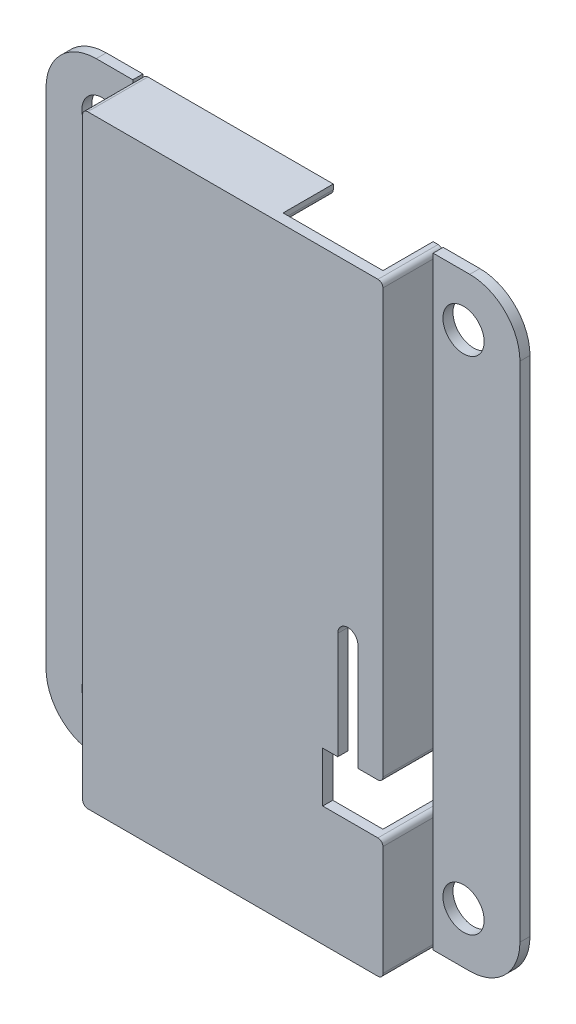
ISO-10303-21;
HEADER;
FILE_DESCRIPTION(('STEP AP214'),'2;1');
FILE_NAME('part.step','',(''),(''),'','','');
FILE_SCHEMA(('AUTOMOTIVE_DESIGN { 1 0 10303 214 1 1 1 1 }'));
ENDSEC;
DATA;
#1=APPLICATION_CONTEXT('core data for automotive mechanical design processes');
#2=APPLICATION_PROTOCOL_DEFINITION('international standard','automotive_design',2000,#1);
#3=PRODUCT_CONTEXT('',#1,'mechanical');
#4=PRODUCT('Part','Part','',(#3));
#5=PRODUCT_RELATED_PRODUCT_CATEGORY('part','',(#4));
#6=PRODUCT_DEFINITION_FORMATION('','',#4);
#7=PRODUCT_DEFINITION_CONTEXT('part definition',#1,'design');
#8=PRODUCT_DEFINITION('design','',#6,#7);
#9=PRODUCT_DEFINITION_SHAPE('','',#8);
#10=(LENGTH_UNIT() NAMED_UNIT(*) SI_UNIT(.MILLI.,.METRE.));
#11=(NAMED_UNIT(*) PLANE_ANGLE_UNIT() SI_UNIT($,.RADIAN.));
#12=(NAMED_UNIT(*) SI_UNIT($,.STERADIAN.) SOLID_ANGLE_UNIT());
#13=UNCERTAINTY_MEASURE_WITH_UNIT(LENGTH_MEASURE(1.E-05),#10,'distance_accuracy_value','');
#14=(GEOMETRIC_REPRESENTATION_CONTEXT(3) GLOBAL_UNCERTAINTY_ASSIGNED_CONTEXT((#13)) GLOBAL_UNIT_ASSIGNED_CONTEXT((#10,
#11,#12)) REPRESENTATION_CONTEXT('',''));
#15=CARTESIAN_POINT('',(0.,0.,0.));
#16=DIRECTION('',(0.,0.,1.));
#17=DIRECTION('',(1.,0.,0.));
#18=AXIS2_PLACEMENT_3D('',#15,#16,#17);
#19=CARTESIAN_POINT('',(7.59995644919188,-6.67082064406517,3.048));
#20=DIRECTION('',(-1.,0.,0.));
#21=DIRECTION('',(0.,-1.,0.));
#22=AXIS2_PLACEMENT_3D('',#19,#20,#21);
#23=PLANE('',#22);
#24=DIRECTION('',(0.,0.,-1.));
#25=VECTOR('',#24,1.);
#26=CARTESIAN_POINT('',(7.59995644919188,-6.41682064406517,3.048));
#27=LINE('',#26,#25);
#28=CARTESIAN_POINT('',(7.59995644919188,-6.41682064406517,3.048));
#29=VERTEX_POINT('',#28);
#30=CARTESIAN_POINT('',(7.59995644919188,-6.41682064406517,0.508));
#31=VERTEX_POINT('',#30);
#32=EDGE_CURVE('E601',#29,#31,#27,.T.);
#33=ORIENTED_EDGE('',*,*,#32,.T.);
#34=DIRECTION('',(0.,1.,0.));
#35=VECTOR('',#34,1.);
#36=CARTESIAN_POINT('',(7.59995644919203,15.2808676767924,0.508));
#37=LINE('',#36,#35);
#38=CARTESIAN_POINT('',(7.59995644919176,15.0240552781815,0.508));
#39=VERTEX_POINT('',#38);
#40=EDGE_CURVE('E48',#31,#39,#37,.T.);
#41=ORIENTED_EDGE('',*,*,#40,.T.);
#42=DIRECTION('',(0.,0.,-1.));
#43=VECTOR('',#42,1.);
#44=CARTESIAN_POINT('',(7.59995644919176,15.0240552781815,3.048));
#45=LINE('',#44,#43);
#46=CARTESIAN_POINT('',(7.59995644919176,15.0240552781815,3.048));
#47=VERTEX_POINT('',#46);
#48=EDGE_CURVE('E603',#39,#47,#45,.F.);
#49=ORIENTED_EDGE('',*,*,#48,.T.);
#50=DIRECTION('',(0.,1.,0.));
#51=VECTOR('',#50,1.);
#52=CARTESIAN_POINT('',(7.59995644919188,-6.67082064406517,3.048));
#53=LINE('',#52,#51);
#54=EDGE_CURVE('E503',#29,#47,#53,.T.);
#55=ORIENTED_EDGE('',*,*,#54,.F.);
#56=EDGE_LOOP('',(#33,#41,#49,#55));
#57=FACE_BOUND('',#56,.T.);
#58=ADVANCED_FACE('F33',(#57),#23,.F.);
#59=CARTESIAN_POINT('',(7.59995644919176,15.2780552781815,3.048));
#60=DIRECTION('',(0.,-1.,0.));
#61=DIRECTION('',(1.,0.,0.));
#62=AXIS2_PLACEMENT_3D('',#59,#60,#61);
#63=PLANE('',#62);
#64=DIRECTION('',(-1.,0.,0.));
#65=VECTOR('',#64,1.);
#66=CARTESIAN_POINT('',(7.59995644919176,15.2780552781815,0.));
#67=LINE('',#66,#65);
#68=CARTESIAN_POINT('',(2.03761357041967,15.2780552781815,0.));
#69=VERTEX_POINT('',#68);
#70=CARTESIAN_POINT('',(-7.34595644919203,15.2780552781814,0.));
#71=VERTEX_POINT('',#70);
#72=EDGE_CURVE('E478',#69,#71,#67,.T.);
#73=ORIENTED_EDGE('',*,*,#72,.T.);
#74=DIRECTION('',(0.,0.,-1.));
#75=VECTOR('',#74,1.);
#76=CARTESIAN_POINT('',(-7.34595644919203,15.2780552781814,3.048));
#77=LINE('',#76,#75);
#78=CARTESIAN_POINT('',(-7.34595644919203,15.2780552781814,3.048));
#79=VERTEX_POINT('',#78);
#80=EDGE_CURVE('E583',#71,#79,#77,.F.);
#81=ORIENTED_EDGE('',*,*,#80,.T.);
#82=DIRECTION('',(-1.,0.,0.));
#83=VECTOR('',#82,1.);
#84=CARTESIAN_POINT('',(7.59995644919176,15.2780552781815,3.048));
#85=LINE('',#84,#83);
#86=CARTESIAN_POINT('',(7.34595644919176,15.2780552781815,3.048));
#87=VERTEX_POINT('',#86);
#88=EDGE_CURVE('E506',#87,#79,#85,.T.);
#89=ORIENTED_EDGE('',*,*,#88,.F.);
#90=DIRECTION('',(0.,0.,-1.));
#91=VECTOR('',#90,1.);
#92=CARTESIAN_POINT('',(7.34595644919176,15.2780552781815,3.048));
#93=LINE('',#92,#91);
#94=CARTESIAN_POINT('',(7.34595644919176,15.2780552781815,0.));
#95=VERTEX_POINT('',#94);
#96=EDGE_CURVE('E580',#87,#95,#93,.T.);
#97=ORIENTED_EDGE('',*,*,#96,.T.);
#98=CARTESIAN_POINT('',(7.09195644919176,15.2780552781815,0.));
#99=VERTEX_POINT('',#98);
#100=EDGE_CURVE('E537',#95,#99,#67,.T.);
#101=ORIENTED_EDGE('',*,*,#100,.T.);
#102=DIRECTION('',(0.,0.,-1.));
#103=VECTOR('',#102,1.);
#104=CARTESIAN_POINT('',(7.09195644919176,15.2780552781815,2.54));
#105=LINE('',#104,#103);
#106=CARTESIAN_POINT('',(7.09195644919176,15.2780552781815,2.54));
#107=VERTEX_POINT('',#106);
#108=EDGE_CURVE('E432',#107,#99,#105,.T.);
#109=ORIENTED_EDGE('',*,*,#108,.F.);
#110=DIRECTION('',(1.,0.,0.));
#111=VECTOR('',#110,1.);
#112=CARTESIAN_POINT('',(2.03761357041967,15.2780552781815,2.54));
#113=LINE('',#112,#111);
#114=CARTESIAN_POINT('',(2.03761357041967,15.2780552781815,2.54));
#115=VERTEX_POINT('',#114);
#116=EDGE_CURVE('E438',#115,#107,#113,.T.);
#117=ORIENTED_EDGE('',*,*,#116,.F.);
#118=DIRECTION('',(0.,0.,1.));
#119=VECTOR('',#118,1.);
#120=CARTESIAN_POINT('',(2.03761357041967,15.2780552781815,0.));
#121=LINE('',#120,#119);
#122=EDGE_CURVE('E435',#69,#115,#121,.T.);
#123=ORIENTED_EDGE('',*,*,#122,.F.);
#124=EDGE_LOOP('',(#73,#81,#89,#97,#101,#109,#117,#123));
#125=FACE_BOUND('',#124,.T.);
#126=ADVANCED_FACE('F721',(#125),#63,.F.);
#127=CARTESIAN_POINT('',(-7.59995644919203,15.2780552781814,3.048));
#128=DIRECTION('',(1.,0.,0.));
#129=DIRECTION('',(0.,1.,0.));
#130=AXIS2_PLACEMENT_3D('',#127,#128,#129);
#131=PLANE('',#130);
#132=DIRECTION('',(0.,0.,-1.));
#133=VECTOR('',#132,1.);
#134=CARTESIAN_POINT('',(-7.59995644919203,15.0240552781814,3.048));
#135=LINE('',#134,#133);
#136=CARTESIAN_POINT('',(-7.59995644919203,15.0240552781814,3.048));
#137=VERTEX_POINT('',#136);
#138=CARTESIAN_POINT('',(-7.59995644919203,15.0240552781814,0.508));
#139=VERTEX_POINT('',#138);
#140=EDGE_CURVE('E567',#137,#139,#135,.T.);
#141=ORIENTED_EDGE('',*,*,#140,.T.);
#142=DIRECTION('',(0.,1.,0.));
#143=VECTOR('',#142,1.);
#144=CARTESIAN_POINT('',(-7.59995644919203,15.2808676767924,0.508));
#145=LINE('',#144,#143);
#146=CARTESIAN_POINT('',(-7.59995644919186,-15.0240552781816,0.508));
#147=VERTEX_POINT('',#146);
#148=EDGE_CURVE('E393',#147,#139,#145,.T.);
#149=ORIENTED_EDGE('',*,*,#148,.F.);
#150=DIRECTION('',(0.,0.,-1.));
#151=VECTOR('',#150,1.);
#152=CARTESIAN_POINT('',(-7.59995644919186,-15.0240552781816,3.048));
#153=LINE('',#152,#151);
#154=CARTESIAN_POINT('',(-7.59995644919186,-15.0240552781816,3.048));
#155=VERTEX_POINT('',#154);
#156=EDGE_CURVE('E563',#147,#155,#153,.F.);
#157=ORIENTED_EDGE('',*,*,#156,.T.);
#158=DIRECTION('',(0.,-1.,0.));
#159=VECTOR('',#158,1.);
#160=CARTESIAN_POINT('',(-7.59995644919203,15.2780552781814,3.048));
#161=LINE('',#160,#159);
#162=EDGE_CURVE('E510',#137,#155,#161,.T.);
#163=ORIENTED_EDGE('',*,*,#162,.F.);
#164=EDGE_LOOP('',(#141,#149,#157,#163));
#165=FACE_BOUND('',#164,.T.);
#166=ADVANCED_FACE('F749',(#165),#131,.F.);
#167=CARTESIAN_POINT('',(7.59995644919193,-15.2780552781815,3.048));
#168=DIRECTION('',(0.,-1.,0.));
#169=DIRECTION('',(1.,0.,0.));
#170=AXIS2_PLACEMENT_3D('',#167,#168,#169);
#171=PLANE('',#170);
#172=DIRECTION('',(-1.,0.,0.));
#173=VECTOR('',#172,1.);
#174=CARTESIAN_POINT('',(7.59995644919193,-15.2780552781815,0.));
#175=LINE('',#174,#173);
#176=CARTESIAN_POINT('',(7.34595644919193,-15.2780552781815,0.));
#177=VERTEX_POINT('',#176);
#178=CARTESIAN_POINT('',(-7.34595644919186,-15.2780552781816,0.));
#179=VERTEX_POINT('',#178);
#180=EDGE_CURVE('E539',#177,#179,#175,.T.);
#181=ORIENTED_EDGE('',*,*,#180,.F.);
#182=DIRECTION('',(0.,0.,-1.));
#183=VECTOR('',#182,1.);
#184=CARTESIAN_POINT('',(7.34595644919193,-15.2780552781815,3.048));
#185=LINE('',#184,#183);
#186=CARTESIAN_POINT('',(7.34595644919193,-15.2780552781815,3.048));
#187=VERTEX_POINT('',#186);
#188=EDGE_CURVE('E41',#177,#187,#185,.F.);
#189=ORIENTED_EDGE('',*,*,#188,.T.);
#190=DIRECTION('',(-1.,0.,0.));
#191=VECTOR('',#190,1.);
#192=CARTESIAN_POINT('',(7.59995644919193,-15.2780552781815,3.048));
#193=LINE('',#192,#191);
#194=CARTESIAN_POINT('',(-7.34595644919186,-15.2780552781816,3.048));
#195=VERTEX_POINT('',#194);
#196=EDGE_CURVE('E513',#187,#195,#193,.T.);
#197=ORIENTED_EDGE('',*,*,#196,.T.);
#198=DIRECTION('',(0.,0.,-1.));
#199=VECTOR('',#198,1.);
#200=CARTESIAN_POINT('',(-7.34595644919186,-15.2780552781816,0.));
#201=LINE('',#200,#199);
#202=EDGE_CURVE('E625',#195,#179,#201,.T.);
#203=ORIENTED_EDGE('',*,*,#202,.T.);
#204=EDGE_LOOP('',(#181,#189,#197,#203));
#205=FACE_BOUND('',#204,.T.);
#206=ADVANCED_FACE('F631',(#205),#171,.T.);
#207=CARTESIAN_POINT('',(7.59995644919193,-15.2780552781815,3.048));
#208=DIRECTION('',(-1.,0.,0.));
#209=DIRECTION('',(0.,-1.,0.));
#210=AXIS2_PLACEMENT_3D('',#207,#208,#209);
#211=PLANE('',#210);
#212=DIRECTION('',(0.,0.,-1.));
#213=VECTOR('',#212,1.);
#214=CARTESIAN_POINT('',(7.59995644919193,-15.0240552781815,0.));
#215=LINE('',#214,#213);
#216=CARTESIAN_POINT('',(7.59995644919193,-15.0240552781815,3.048));
#217=VERTEX_POINT('',#216);
#218=CARTESIAN_POINT('',(7.59995644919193,-15.0240552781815,0.508));
#219=VERTEX_POINT('',#218);
#220=EDGE_CURVE('E618',#217,#219,#215,.T.);
#221=ORIENTED_EDGE('',*,*,#220,.T.);
#222=CARTESIAN_POINT('',(7.5999564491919,-9.46482064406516,0.508));
#223=VERTEX_POINT('',#222);
#224=EDGE_CURVE('E339',#219,#223,#37,.T.);
#225=ORIENTED_EDGE('',*,*,#224,.T.);
#226=DIRECTION('',(0.,0.,-1.));
#227=VECTOR('',#226,1.);
#228=CARTESIAN_POINT('',(7.5999564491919,-9.46482064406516,3.048));
#229=LINE('',#228,#227);
#230=CARTESIAN_POINT('',(7.5999564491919,-9.46482064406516,3.048));
#231=VERTEX_POINT('',#230);
#232=EDGE_CURVE('E621',#223,#231,#229,.F.);
#233=ORIENTED_EDGE('',*,*,#232,.T.);
#234=DIRECTION('',(0.,1.,0.));
#235=VECTOR('',#234,1.);
#236=CARTESIAN_POINT('',(7.59995644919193,-15.2780552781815,3.048));
#237=LINE('',#236,#235);
#238=EDGE_CURVE('E516',#217,#231,#237,.T.);
#239=ORIENTED_EDGE('',*,*,#238,.F.);
#240=EDGE_LOOP('',(#221,#225,#233,#239));
#241=FACE_BOUND('',#240,.T.);
#242=ADVANCED_FACE('F644',(#241),#211,.F.);
#243=CARTESIAN_POINT('',(7.59995644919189,-9.21082064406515,3.048));
#244=DIRECTION('',(0.,-1.,0.));
#245=DIRECTION('',(1.,0.,0.));
#246=AXIS2_PLACEMENT_3D('',#243,#244,#245);
#247=PLANE('',#246);
#248=DIRECTION('',(-1.,0.,0.));
#249=VECTOR('',#248,1.);
#250=CARTESIAN_POINT('',(7.59995644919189,-9.21082064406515,3.048));
#251=LINE('',#250,#249);
#252=CARTESIAN_POINT('',(7.3459564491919,-9.21082064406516,3.048));
#253=VERTEX_POINT('',#252);
#254=CARTESIAN_POINT('',(4.55195644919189,-9.21082064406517,3.048));
#255=VERTEX_POINT('',#254);
#256=EDGE_CURVE('E519',#253,#255,#251,.T.);
#257=ORIENTED_EDGE('',*,*,#256,.F.);
#258=DIRECTION('',(0.,0.,-1.));
#259=VECTOR('',#258,1.);
#260=CARTESIAN_POINT('',(7.3459564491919,-9.21082064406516,3.048));
#261=LINE('',#260,#259);
#262=CARTESIAN_POINT('',(7.3459564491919,-9.21082064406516,0.));
#263=VERTEX_POINT('',#262);
#264=EDGE_CURVE('E614',#253,#263,#261,.T.);
#265=ORIENTED_EDGE('',*,*,#264,.T.);
#266=DIRECTION('',(-1.,0.,0.));
#267=VECTOR('',#266,1.);
#268=CARTESIAN_POINT('',(7.59995644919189,-9.21082064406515,0.));
#269=LINE('',#268,#267);
#270=CARTESIAN_POINT('',(7.0919564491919,-9.21082064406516,0.));
#271=VERTEX_POINT('',#270);
#272=EDGE_CURVE('E542',#263,#271,#269,.T.);
#273=ORIENTED_EDGE('',*,*,#272,.T.);
#274=DIRECTION('',(0.,0.,1.));
#275=VECTOR('',#274,1.);
#276=CARTESIAN_POINT('',(7.0919564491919,-9.21082064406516,3.048));
#277=LINE('',#276,#275);
#278=CARTESIAN_POINT('',(7.0919564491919,-9.21082064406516,2.54));
#279=VERTEX_POINT('',#278);
#280=EDGE_CURVE('E448',#271,#279,#277,.T.);
#281=ORIENTED_EDGE('',*,*,#280,.T.);
#282=DIRECTION('',(-1.,0.,0.));
#283=VECTOR('',#282,1.);
#284=CARTESIAN_POINT('',(7.59995644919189,-9.21082064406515,2.54));
#285=LINE('',#284,#283);
#286=CARTESIAN_POINT('',(4.55195644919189,-9.21082064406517,2.54));
#287=VERTEX_POINT('',#286);
#288=EDGE_CURVE('E467',#279,#287,#285,.T.);
#289=ORIENTED_EDGE('',*,*,#288,.T.);
#290=DIRECTION('',(0.,0.,-1.));
#291=VECTOR('',#290,1.);
#292=CARTESIAN_POINT('',(4.55195644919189,-9.21082064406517,3.048));
#293=LINE('',#292,#291);
#294=EDGE_CURVE('E560',#255,#287,#293,.T.);
#295=ORIENTED_EDGE('',*,*,#294,.F.);
#296=EDGE_LOOP('',(#257,#265,#273,#281,#289,#295));
#297=FACE_BOUND('',#296,.T.);
#298=ADVANCED_FACE('F684',(#297),#247,.F.);
#299=CARTESIAN_POINT('',(4.55195644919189,-9.21082064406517,3.048));
#300=DIRECTION('',(-1.,0.,0.));
#301=DIRECTION('',(0.,0.,1.));
#302=AXIS2_PLACEMENT_3D('',#299,#300,#301);
#303=PLANE('',#302);
#304=ORIENTED_EDGE('',*,*,#294,.T.);
#305=DIRECTION('',(0.,1.,0.));
#306=VECTOR('',#305,1.);
#307=CARTESIAN_POINT('',(4.55195644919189,-9.21082064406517,2.54));
#308=LINE('',#307,#306);
#309=CARTESIAN_POINT('',(4.55195644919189,-6.67082064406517,2.54));
#310=VERTEX_POINT('',#309);
#311=EDGE_CURVE('E464',#287,#310,#308,.T.);
#312=ORIENTED_EDGE('',*,*,#311,.T.);
#313=DIRECTION('',(0.,0.,-1.));
#314=VECTOR('',#313,1.);
#315=CARTESIAN_POINT('',(4.55195644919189,-6.67082064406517,3.048));
#316=LINE('',#315,#314);
#317=CARTESIAN_POINT('',(4.55195644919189,-6.67082064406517,3.048));
#318=VERTEX_POINT('',#317);
#319=EDGE_CURVE('E557',#318,#310,#316,.T.);
#320=ORIENTED_EDGE('',*,*,#319,.F.);
#321=DIRECTION('',(0.,1.,0.));
#322=VECTOR('',#321,1.);
#323=CARTESIAN_POINT('',(4.55195644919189,-9.21082064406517,3.048));
#324=LINE('',#323,#322);
#325=EDGE_CURVE('E521',#255,#318,#324,.T.);
#326=ORIENTED_EDGE('',*,*,#325,.F.);
#327=EDGE_LOOP('',(#304,#312,#320,#326));
#328=FACE_BOUND('',#327,.T.);
#329=ADVANCED_FACE('F690',(#328),#303,.F.);
#330=CARTESIAN_POINT('',(4.55195644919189,-6.67082064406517,3.048));
#331=DIRECTION('',(0.,1.,0.));
#332=DIRECTION('',(0.,0.,1.));
#333=AXIS2_PLACEMENT_3D('',#330,#331,#332);
#334=PLANE('',#333);
#335=ORIENTED_EDGE('',*,*,#319,.T.);
#336=DIRECTION('',(1.,0.,0.));
#337=VECTOR('',#336,1.);
#338=CARTESIAN_POINT('',(4.55195644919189,-6.67082064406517,2.54));
#339=LINE('',#338,#337);
#340=CARTESIAN_POINT('',(5.3151798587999,-6.67082064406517,2.54));
#341=VERTEX_POINT('',#340);
#342=EDGE_CURVE('E461',#310,#341,#339,.T.);
#343=ORIENTED_EDGE('',*,*,#342,.T.);
#344=DIRECTION('',(0.,0.,-1.));
#345=VECTOR('',#344,1.);
#346=CARTESIAN_POINT('',(5.3151798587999,-6.67082064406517,3.048));
#347=LINE('',#346,#345);
#348=CARTESIAN_POINT('',(5.3151798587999,-6.67082064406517,3.048));
#349=VERTEX_POINT('',#348);
#350=EDGE_CURVE('E554',#349,#341,#347,.T.);
#351=ORIENTED_EDGE('',*,*,#350,.F.);
#352=DIRECTION('',(1.,0.,0.));
#353=VECTOR('',#352,1.);
#354=CARTESIAN_POINT('',(4.55195644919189,-6.67082064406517,3.048));
#355=LINE('',#354,#353);
#356=EDGE_CURVE('E523',#318,#349,#355,.T.);
#357=ORIENTED_EDGE('',*,*,#356,.F.);
#358=EDGE_LOOP('',(#335,#343,#351,#357));
#359=FACE_BOUND('',#358,.T.);
#360=ADVANCED_FACE('F697',(#359),#334,.F.);
#361=CARTESIAN_POINT('',(5.3151798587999,-6.67082064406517,3.048));
#362=DIRECTION('',(-1.,0.,0.));
#363=DIRECTION('',(0.,0.,1.));
#364=AXIS2_PLACEMENT_3D('',#361,#362,#363);
#365=PLANE('',#364);
#366=ORIENTED_EDGE('',*,*,#350,.T.);
#367=DIRECTION('',(0.,1.,0.));
#368=VECTOR('',#367,1.);
#369=CARTESIAN_POINT('',(5.3151798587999,-6.67082064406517,2.54));
#370=LINE('',#369,#368);
#371=CARTESIAN_POINT('',(5.3151798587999,-1.25595462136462,2.54));
#372=VERTEX_POINT('',#371);
#373=EDGE_CURVE('E458',#341,#372,#370,.T.);
#374=ORIENTED_EDGE('',*,*,#373,.T.);
#375=DIRECTION('',(0.,0.,-1.));
#376=VECTOR('',#375,1.);
#377=CARTESIAN_POINT('',(5.3151798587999,-1.25595462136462,3.048));
#378=LINE('',#377,#376);
#379=CARTESIAN_POINT('',(5.3151798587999,-1.25595462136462,3.048));
#380=VERTEX_POINT('',#379);
#381=EDGE_CURVE('E551',#380,#372,#378,.T.);
#382=ORIENTED_EDGE('',*,*,#381,.F.);
#383=DIRECTION('',(0.,1.,0.));
#384=VECTOR('',#383,1.);
#385=CARTESIAN_POINT('',(5.3151798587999,-6.67082064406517,3.048));
#386=LINE('',#385,#384);
#387=EDGE_CURVE('E525',#349,#380,#386,.T.);
#388=ORIENTED_EDGE('',*,*,#387,.F.);
#389=EDGE_LOOP('',(#366,#374,#382,#388));
#390=FACE_BOUND('',#389,.T.);
#391=ADVANCED_FACE('F699',(#390),#365,.F.);
#392=CARTESIAN_POINT('',(5.8231798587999,-1.25595462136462,3.048));
#393=DIRECTION('',(0.,0.,-1.));
#394=DIRECTION('',(-1.,0.,0.));
#395=AXIS2_PLACEMENT_3D('',#392,#393,#394);
#396=CYLINDRICAL_SURFACE('',#395,0.508000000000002);
#397=CARTESIAN_POINT('',(5.8231798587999,-1.25595462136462,2.54));
#398=DIRECTION('',(0.,0.,1.));
#399=DIRECTION('',(1.,0.,0.));
#400=AXIS2_PLACEMENT_3D('',#397,#398,#399);
#401=CIRCLE('',#400,0.508000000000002);
#402=CARTESIAN_POINT('',(6.3311798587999,-1.25595462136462,2.54));
#403=VERTEX_POINT('',#402);
#404=EDGE_CURVE('E456',#403,#372,#401,.T.);
#405=ORIENTED_EDGE('',*,*,#404,.F.);
#406=DIRECTION('',(0.,0.,-1.));
#407=VECTOR('',#406,1.);
#408=CARTESIAN_POINT('',(6.3311798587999,-1.25595462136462,3.048));
#409=LINE('',#408,#407);
#410=CARTESIAN_POINT('',(6.3311798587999,-1.25595462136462,3.048));
#411=VERTEX_POINT('',#410);
#412=EDGE_CURVE('E548',#411,#403,#409,.T.);
#413=ORIENTED_EDGE('',*,*,#412,.F.);
#414=CARTESIAN_POINT('',(5.8231798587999,-1.25595462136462,3.048));
#415=DIRECTION('',(0.,0.,1.));
#416=DIRECTION('',(1.,0.,0.));
#417=AXIS2_PLACEMENT_3D('',#414,#415,#416);
#418=CIRCLE('',#417,0.508000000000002);
#419=EDGE_CURVE('E527',#411,#380,#418,.T.);
#420=ORIENTED_EDGE('',*,*,#419,.T.);
#421=ORIENTED_EDGE('',*,*,#381,.T.);
#422=EDGE_LOOP('',(#405,#413,#420,#421));
#423=FACE_BOUND('',#422,.T.);
#424=ADVANCED_FACE('F702',(#423),#396,.F.);
#425=CARTESIAN_POINT('',(6.33117985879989,-6.67082064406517,3.048));
#426=DIRECTION('',(-1.,0.,0.));
#427=DIRECTION('',(0.,-1.,0.));
#428=AXIS2_PLACEMENT_3D('',#425,#426,#427);
#429=PLANE('',#428);
#430=DIRECTION('',(0.,1.,0.));
#431=VECTOR('',#430,1.);
#432=CARTESIAN_POINT('',(6.33117985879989,-6.67082064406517,2.54));
#433=LINE('',#432,#431);
#434=CARTESIAN_POINT('',(6.33117985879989,-6.67082064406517,2.54));
#435=VERTEX_POINT('',#434);
#436=EDGE_CURVE('E454',#435,#403,#433,.T.);
#437=ORIENTED_EDGE('',*,*,#436,.F.);
#438=DIRECTION('',(0.,0.,-1.));
#439=VECTOR('',#438,1.);
#440=CARTESIAN_POINT('',(6.33117985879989,-6.67082064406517,3.048));
#441=LINE('',#440,#439);
#442=CARTESIAN_POINT('',(6.33117985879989,-6.67082064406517,3.048));
#443=VERTEX_POINT('',#442);
#444=EDGE_CURVE('E536',#443,#435,#441,.T.);
#445=ORIENTED_EDGE('',*,*,#444,.F.);
#446=DIRECTION('',(0.,1.,0.));
#447=VECTOR('',#446,1.);
#448=CARTESIAN_POINT('',(6.33117985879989,-6.67082064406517,3.048));
#449=LINE('',#448,#447);
#450=EDGE_CURVE('E530',#443,#411,#449,.T.);
#451=ORIENTED_EDGE('',*,*,#450,.T.);
#452=ORIENTED_EDGE('',*,*,#412,.T.);
#453=EDGE_LOOP('',(#437,#445,#451,#452));
#454=FACE_BOUND('',#453,.T.);
#455=ADVANCED_FACE('F706',(#454),#429,.T.);
#456=CARTESIAN_POINT('',(6.33117985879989,-6.67082064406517,3.048));
#457=DIRECTION('',(0.,1.,0.));
#458=DIRECTION('',(0.,0.,1.));
#459=AXIS2_PLACEMENT_3D('',#456,#457,#458);
#460=PLANE('',#459);
#461=DIRECTION('',(1.,0.,0.));
#462=VECTOR('',#461,1.);
#463=CARTESIAN_POINT('',(6.33117985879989,-6.67082064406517,0.));
#464=LINE('',#463,#462);
#465=CARTESIAN_POINT('',(7.09195644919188,-6.67082064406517,0.));
#466=VERTEX_POINT('',#465);
#467=CARTESIAN_POINT('',(7.34595644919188,-6.67082064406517,0.));
#468=VERTEX_POINT('',#467);
#469=EDGE_CURVE('E507',#466,#468,#464,.T.);
#470=ORIENTED_EDGE('',*,*,#469,.T.);
#471=DIRECTION('',(0.,0.,-1.));
#472=VECTOR('',#471,1.);
#473=CARTESIAN_POINT('',(7.34595644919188,-6.67082064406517,3.048));
#474=LINE('',#473,#472);
#475=CARTESIAN_POINT('',(7.34595644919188,-6.67082064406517,3.048));
#476=VERTEX_POINT('',#475);
#477=EDGE_CURVE('E612',#468,#476,#474,.F.);
#478=ORIENTED_EDGE('',*,*,#477,.T.);
#479=DIRECTION('',(1.,0.,0.));
#480=VECTOR('',#479,1.);
#481=CARTESIAN_POINT('',(6.33117985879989,-6.67082064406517,3.048));
#482=LINE('',#481,#480);
#483=EDGE_CURVE('E533',#443,#476,#482,.T.);
#484=ORIENTED_EDGE('',*,*,#483,.F.);
#485=ORIENTED_EDGE('',*,*,#444,.T.);
#486=DIRECTION('',(1.,0.,0.));
#487=VECTOR('',#486,1.);
#488=CARTESIAN_POINT('',(6.33117985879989,-6.67082064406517,2.54));
#489=LINE('',#488,#487);
#490=CARTESIAN_POINT('',(7.09195644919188,-6.67082064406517,2.54));
#491=VERTEX_POINT('',#490);
#492=EDGE_CURVE('E451',#435,#491,#489,.T.);
#493=ORIENTED_EDGE('',*,*,#492,.T.);
#494=DIRECTION('',(0.,0.,-1.));
#495=VECTOR('',#494,1.);
#496=CARTESIAN_POINT('',(7.09195644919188,-6.67082064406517,3.048));
#497=LINE('',#496,#495);
#498=EDGE_CURVE('E444',#491,#466,#497,.T.);
#499=ORIENTED_EDGE('',*,*,#498,.T.);
#500=EDGE_LOOP('',(#470,#478,#484,#485,#493,#499));
#501=FACE_BOUND('',#500,.T.);
#502=ADVANCED_FACE('F709',(#501),#460,.F.);
#503=CARTESIAN_POINT('',(5.8231798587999,-1.25595462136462,3.048));
#504=DIRECTION('',(0.,0.,1.));
#505=DIRECTION('',(1.,0.,0.));
#506=AXIS2_PLACEMENT_3D('',#503,#504,#505);
#507=PLANE('',#506);
#508=ORIENTED_EDGE('',*,*,#88,.T.);
#509=CARTESIAN_POINT('',(-7.34595644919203,15.0240552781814,3.048));
#510=DIRECTION('',(0.,0.,1.));
#511=DIRECTION('',(1.,0.,0.));
#512=AXIS2_PLACEMENT_3D('',#509,#510,#511);
#513=CIRCLE('',#512,0.254);
#514=EDGE_CURVE('E595',#79,#137,#513,.T.);
#515=ORIENTED_EDGE('',*,*,#514,.T.);
#516=ORIENTED_EDGE('',*,*,#162,.T.);
#517=CARTESIAN_POINT('',(-7.34595644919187,-15.0240552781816,3.048));
#518=DIRECTION('',(0.,0.,1.));
#519=DIRECTION('',(1.,0.,0.));
#520=AXIS2_PLACEMENT_3D('',#517,#518,#519);
#521=CIRCLE('',#520,0.254);
#522=EDGE_CURVE('E585',#155,#195,#521,.T.);
#523=ORIENTED_EDGE('',*,*,#522,.T.);
#524=ORIENTED_EDGE('',*,*,#196,.F.);
#525=CARTESIAN_POINT('',(7.34595644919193,-15.0240552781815,3.048));
#526=DIRECTION('',(0.,0.,1.));
#527=DIRECTION('',(1.,0.,0.));
#528=AXIS2_PLACEMENT_3D('',#525,#526,#527);
#529=CIRCLE('',#528,0.254);
#530=EDGE_CURVE('E587',#187,#217,#529,.T.);
#531=ORIENTED_EDGE('',*,*,#530,.T.);
#532=ORIENTED_EDGE('',*,*,#238,.T.);
#533=CARTESIAN_POINT('',(7.3459564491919,-9.46482064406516,3.048));
#534=DIRECTION('',(0.,0.,1.));
#535=DIRECTION('',(1.,0.,0.));
#536=AXIS2_PLACEMENT_3D('',#533,#534,#535);
#537=CIRCLE('',#536,0.254);
#538=EDGE_CURVE('E589',#231,#253,#537,.T.);
#539=ORIENTED_EDGE('',*,*,#538,.T.);
#540=ORIENTED_EDGE('',*,*,#256,.T.);
#541=ORIENTED_EDGE('',*,*,#325,.T.);
#542=ORIENTED_EDGE('',*,*,#356,.T.);
#543=ORIENTED_EDGE('',*,*,#387,.T.);
#544=ORIENTED_EDGE('',*,*,#419,.F.);
#545=ORIENTED_EDGE('',*,*,#450,.F.);
#546=ORIENTED_EDGE('',*,*,#483,.T.);
#547=CARTESIAN_POINT('',(7.34595644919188,-6.41682064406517,3.048));
#548=DIRECTION('',(0.,0.,1.));
#549=DIRECTION('',(1.,0.,0.));
#550=AXIS2_PLACEMENT_3D('',#547,#548,#549);
#551=CIRCLE('',#550,0.254);
#552=EDGE_CURVE('E591',#476,#29,#551,.T.);
#553=ORIENTED_EDGE('',*,*,#552,.T.);
#554=ORIENTED_EDGE('',*,*,#54,.T.);
#555=CARTESIAN_POINT('',(7.34595644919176,15.0240552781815,3.048));
#556=DIRECTION('',(0.,0.,1.));
#557=DIRECTION('',(1.,0.,0.));
#558=AXIS2_PLACEMENT_3D('',#555,#556,#557);
#559=CIRCLE('',#558,0.254);
#560=EDGE_CURVE('E593',#47,#87,#559,.T.);
#561=ORIENTED_EDGE('',*,*,#560,.T.);
#562=EDGE_LOOP('',(#508,#515,#516,#523,#524,#531,#532,#539,#540,#541,#542,#543,#544,#545,#546,
#553,#554,#561));
#563=FACE_BOUND('',#562,.T.);
#564=ADVANCED_FACE('F636',(#563),#507,.T.);
#565=CARTESIAN_POINT('',(5.8231798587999,-1.25595462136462,0.));
#566=DIRECTION('',(0.,0.,1.));
#567=DIRECTION('',(1.,0.,0.));
#568=AXIS2_PLACEMENT_3D('',#565,#566,#567);
#569=PLANE('',#568);
#570=ORIENTED_EDGE('',*,*,#100,.F.);
#571=CARTESIAN_POINT('',(7.34595644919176,15.0240552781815,0.));
#572=DIRECTION('',(0.,0.,1.));
#573=DIRECTION('',(1.,0.,0.));
#574=AXIS2_PLACEMENT_3D('',#571,#572,#573);
#575=CIRCLE('',#574,0.254);
#576=CARTESIAN_POINT('',(7.59995644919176,15.0240552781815,0.));
#577=VERTEX_POINT('',#576);
#578=EDGE_CURVE('E599',#95,#577,#575,.F.);
#579=ORIENTED_EDGE('',*,*,#578,.T.);
#580=DIRECTION('',(0.,1.,0.));
#581=VECTOR('',#580,1.);
#582=CARTESIAN_POINT('',(7.59995644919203,15.2808676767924,0.));
#583=LINE('',#582,#581);
#584=CARTESIAN_POINT('',(7.59995644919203,15.2808676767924,0.));
#585=VERTEX_POINT('',#584);
#586=EDGE_CURVE('E352',#577,#585,#583,.T.);
#587=ORIENTED_EDGE('',*,*,#586,.T.);
#588=DIRECTION('',(1.,0.,0.));
#589=VECTOR('',#588,1.);
#590=CARTESIAN_POINT('',(7.59995644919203,15.2808676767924,0.));
#591=LINE('',#590,#589);
#592=CARTESIAN_POINT('',(9.45449480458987,15.2808676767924,0.));
#593=VERTEX_POINT('',#592);
#594=EDGE_CURVE('E349',#585,#593,#591,.T.);
#595=ORIENTED_EDGE('',*,*,#594,.T.);
#596=CARTESIAN_POINT('',(9.45449480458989,12.7408676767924,0.));
#597=DIRECTION('',(0.,0.,-1.));
#598=DIRECTION('',(1.,0.,0.));
#599=AXIS2_PLACEMENT_3D('',#596,#597,#598);
#600=CIRCLE('',#599,2.54);
#601=CARTESIAN_POINT('',(11.9944948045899,12.7408676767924,0.));
#602=VERTEX_POINT('',#601);
#603=EDGE_CURVE('E346',#593,#602,#600,.T.);
#604=ORIENTED_EDGE('',*,*,#603,.T.);
#605=DIRECTION('',(0.,-1.,0.));
#606=VECTOR('',#605,1.);
#607=CARTESIAN_POINT('',(11.9944948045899,12.7408676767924,0.));
#608=LINE('',#607,#606);
#609=CARTESIAN_POINT('',(11.9944948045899,-12.729101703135,0.));
#610=VERTEX_POINT('',#609);
#611=EDGE_CURVE('E343',#602,#610,#608,.T.);
#612=ORIENTED_EDGE('',*,*,#611,.T.);
#613=CARTESIAN_POINT('',(9.45449480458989,-12.729101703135,0.));
#614=DIRECTION('',(0.,0.,-1.));
#615=DIRECTION('',(-1.,0.,0.));
#616=AXIS2_PLACEMENT_3D('',#613,#614,#615);
#617=CIRCLE('',#616,2.54);
#618=CARTESIAN_POINT('',(9.45449480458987,-15.269101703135,0.));
#619=VERTEX_POINT('',#618);
#620=EDGE_CURVE('E308',#610,#619,#617,.T.);
#621=ORIENTED_EDGE('',*,*,#620,.T.);
#622=DIRECTION('',(-1.,0.,0.));
#623=VECTOR('',#622,1.);
#624=CARTESIAN_POINT('',(7.59995644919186,-15.269101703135,0.));
#625=LINE('',#624,#623);
#626=CARTESIAN_POINT('',(7.59995644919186,-15.269101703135,0.));
#627=VERTEX_POINT('',#626);
#628=EDGE_CURVE('E324',#619,#627,#625,.T.);
#629=ORIENTED_EDGE('',*,*,#628,.T.);
#630=CARTESIAN_POINT('',(7.59995644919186,-15.0240552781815,0.));
#631=VERTEX_POINT('',#630);
#632=EDGE_CURVE('E353',#627,#631,#583,.T.);
#633=ORIENTED_EDGE('',*,*,#632,.T.);
#634=CARTESIAN_POINT('',(7.34595644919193,-15.0240552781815,0.));
#635=DIRECTION('',(0.,0.,1.));
#636=DIRECTION('',(1.,0.,0.));
#637=AXIS2_PLACEMENT_3D('',#634,#635,#636);
#638=CIRCLE('',#637,0.254);
#639=EDGE_CURVE('E572',#631,#177,#638,.F.);
#640=ORIENTED_EDGE('',*,*,#639,.T.);
#641=ORIENTED_EDGE('',*,*,#180,.T.);
#642=CARTESIAN_POINT('',(-7.34595644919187,-15.0240552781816,0.));
#643=DIRECTION('',(0.,0.,1.));
#644=DIRECTION('',(1.,0.,0.));
#645=AXIS2_PLACEMENT_3D('',#642,#643,#644);
#646=CIRCLE('',#645,0.254);
#647=CARTESIAN_POINT('',(-7.59995644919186,-15.0240552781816,0.));
#648=VERTEX_POINT('',#647);
#649=EDGE_CURVE('E570',#179,#648,#646,.F.);
#650=ORIENTED_EDGE('',*,*,#649,.T.);
#651=DIRECTION('',(0.,1.,0.));
#652=VECTOR('',#651,1.);
#653=CARTESIAN_POINT('',(-7.59995644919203,15.2808676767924,0.));
#654=LINE('',#653,#652);
#655=CARTESIAN_POINT('',(-7.59995644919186,-15.269101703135,0.));
#656=VERTEX_POINT('',#655);
#657=EDGE_CURVE('E405',#656,#648,#654,.T.);
#658=ORIENTED_EDGE('',*,*,#657,.F.);
#659=DIRECTION('',(1.,0.,0.));
#660=VECTOR('',#659,1.);
#661=CARTESIAN_POINT('',(-7.59995644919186,-15.269101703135,0.));
#662=LINE('',#661,#660);
#663=CARTESIAN_POINT('',(-9.45449480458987,-15.269101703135,0.));
#664=VERTEX_POINT('',#663);
#665=EDGE_CURVE('E402',#664,#656,#662,.T.);
#666=ORIENTED_EDGE('',*,*,#665,.F.);
#667=CARTESIAN_POINT('',(-9.45449480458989,-12.729101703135,0.));
#668=DIRECTION('',(0.,0.,1.));
#669=DIRECTION('',(1.,0.,0.));
#670=AXIS2_PLACEMENT_3D('',#667,#668,#669);
#671=CIRCLE('',#670,2.54);
#672=CARTESIAN_POINT('',(-11.9944948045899,-12.729101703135,0.));
#673=VERTEX_POINT('',#672);
#674=EDGE_CURVE('E379',#673,#664,#671,.T.);
#675=ORIENTED_EDGE('',*,*,#674,.F.);
#676=DIRECTION('',(0.,-1.,0.));
#677=VECTOR('',#676,1.);
#678=CARTESIAN_POINT('',(-11.9944948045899,12.7408676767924,0.));
#679=LINE('',#678,#677);
#680=CARTESIAN_POINT('',(-11.9944948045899,12.7408676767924,0.));
#681=VERTEX_POINT('',#680);
#682=EDGE_CURVE('E386',#681,#673,#679,.T.);
#683=ORIENTED_EDGE('',*,*,#682,.F.);
#684=CARTESIAN_POINT('',(-9.45449480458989,12.7408676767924,0.));
#685=DIRECTION('',(0.,0.,1.));
#686=DIRECTION('',(-1.,0.,0.));
#687=AXIS2_PLACEMENT_3D('',#684,#685,#686);
#688=CIRCLE('',#687,2.54);
#689=CARTESIAN_POINT('',(-9.45449480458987,15.2808676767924,0.));
#690=VERTEX_POINT('',#689);
#691=EDGE_CURVE('E410',#690,#681,#688,.T.);
#692=ORIENTED_EDGE('',*,*,#691,.F.);
#693=DIRECTION('',(-1.,0.,0.));
#694=VECTOR('',#693,1.);
#695=CARTESIAN_POINT('',(-7.59995644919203,15.2808676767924,0.));
#696=LINE('',#695,#694);
#697=CARTESIAN_POINT('',(-7.59995644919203,15.2808676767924,0.));
#698=VERTEX_POINT('',#697);
#699=EDGE_CURVE('E408',#698,#690,#696,.T.);
#700=ORIENTED_EDGE('',*,*,#699,.F.);
#701=CARTESIAN_POINT('',(-7.59995644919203,15.0240552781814,0.));
#702=VERTEX_POINT('',#701);
#703=EDGE_CURVE('E404',#702,#698,#654,.T.);
#704=ORIENTED_EDGE('',*,*,#703,.F.);
#705=CARTESIAN_POINT('',(-7.34595644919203,15.0240552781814,0.));
#706=DIRECTION('',(0.,0.,1.));
#707=DIRECTION('',(1.,0.,0.));
#708=AXIS2_PLACEMENT_3D('',#705,#706,#707);
#709=CIRCLE('',#708,0.254);
#710=EDGE_CURVE('E578',#702,#71,#709,.F.);
#711=ORIENTED_EDGE('',*,*,#710,.T.);
#712=ORIENTED_EDGE('',*,*,#72,.F.);
#713=DIRECTION('',(0.,1.,0.));
#714=VECTOR('',#713,1.);
#715=CARTESIAN_POINT('',(2.03761357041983,-14.7700552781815,0.));
#716=LINE('',#715,#714);
#717=CARTESIAN_POINT('',(2.03761357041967,15.0240552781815,0.));
#718=VERTEX_POINT('',#717);
#719=EDGE_CURVE('E441',#718,#69,#716,.T.);
#720=ORIENTED_EDGE('',*,*,#719,.F.);
#721=CARTESIAN_POINT('',(1.78361357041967,15.0240552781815,0.));
#722=DIRECTION('',(0.,0.,1.));
#723=DIRECTION('',(1.,0.,0.));
#724=AXIS2_PLACEMENT_3D('',#721,#722,#723);
#725=CIRCLE('',#724,0.254);
#726=CARTESIAN_POINT('',(1.78361357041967,14.7700552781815,0.));
#727=VERTEX_POINT('',#726);
#728=EDGE_CURVE('E576',#718,#727,#725,.F.);
#729=ORIENTED_EDGE('',*,*,#728,.T.);
#730=DIRECTION('',(-1.,0.,0.));
#731=VECTOR('',#730,1.);
#732=CARTESIAN_POINT('',(7.59995644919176,14.7700552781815,0.));
#733=LINE('',#732,#731);
#734=CARTESIAN_POINT('',(-7.09195644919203,14.7700552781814,0.));
#735=VERTEX_POINT('',#734);
#736=EDGE_CURVE('E494',#727,#735,#733,.T.);
#737=ORIENTED_EDGE('',*,*,#736,.T.);
#738=DIRECTION('',(0.,-1.,0.));
#739=VECTOR('',#738,1.);
#740=CARTESIAN_POINT('',(-7.09195644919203,15.2780552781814,0.));
#741=LINE('',#740,#739);
#742=CARTESIAN_POINT('',(-7.09195644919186,-14.7700552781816,0.));
#743=VERTEX_POINT('',#742);
#744=EDGE_CURVE('E499',#735,#743,#741,.T.);
#745=ORIENTED_EDGE('',*,*,#744,.T.);
#746=DIRECTION('',(-1.,0.,0.));
#747=VECTOR('',#746,1.);
#748=CARTESIAN_POINT('',(7.59995644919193,-14.7700552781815,0.));
#749=LINE('',#748,#747);
#750=CARTESIAN_POINT('',(7.09195644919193,-14.7700552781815,0.));
#751=VERTEX_POINT('',#750);
#752=EDGE_CURVE('E497',#751,#743,#749,.T.);
#753=ORIENTED_EDGE('',*,*,#752,.F.);
#754=DIRECTION('',(0.,1.,0.));
#755=VECTOR('',#754,1.);
#756=CARTESIAN_POINT('',(7.09195644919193,-15.2780552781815,0.));
#757=LINE('',#756,#755);
#758=EDGE_CURVE('E474',#751,#271,#757,.T.);
#759=ORIENTED_EDGE('',*,*,#758,.T.);
#760=ORIENTED_EDGE('',*,*,#272,.F.);
#761=CARTESIAN_POINT('',(7.3459564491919,-9.46482064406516,0.));
#762=DIRECTION('',(0.,0.,1.));
#763=DIRECTION('',(1.,0.,0.));
#764=AXIS2_PLACEMENT_3D('',#761,#762,#763);
#765=CIRCLE('',#764,0.254);
#766=CARTESIAN_POINT('',(7.5999564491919,-9.46482064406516,0.));
#767=VERTEX_POINT('',#766);
#768=EDGE_CURVE('E574',#263,#767,#765,.F.);
#769=ORIENTED_EDGE('',*,*,#768,.T.);
#770=CARTESIAN_POINT('',(7.59995644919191,-6.41682064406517,0.));
#771=VERTEX_POINT('',#770);
#772=EDGE_CURVE('E356',#767,#771,#583,.T.);
#773=ORIENTED_EDGE('',*,*,#772,.T.);
#774=CARTESIAN_POINT('',(7.34595644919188,-6.41682064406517,0.));
#775=DIRECTION('',(0.,0.,1.));
#776=DIRECTION('',(1.,0.,0.));
#777=AXIS2_PLACEMENT_3D('',#774,#775,#776);
#778=CIRCLE('',#777,0.254);
#779=EDGE_CURVE('E597',#771,#468,#778,.F.);
#780=ORIENTED_EDGE('',*,*,#779,.T.);
#781=ORIENTED_EDGE('',*,*,#469,.F.);
#782=DIRECTION('',(0.,1.,0.));
#783=VECTOR('',#782,1.);
#784=CARTESIAN_POINT('',(7.09195644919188,-6.67082064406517,0.));
#785=LINE('',#784,#783);
#786=EDGE_CURVE('E470',#466,#99,#785,.T.);
#787=ORIENTED_EDGE('',*,*,#786,.T.);
#788=EDGE_LOOP('',(#570,#579,#587,#595,#604,#612,#621,#629,#633,#640,#641,#650,#658,#666,#675,
#683,#692,#700,#704,#711,#712,#720,#729,#737,#745,#753,#759,#760,#769,#773,#780,#781,#787));
#789=FACE_BOUND('',#788,.T.);
#790=CARTESIAN_POINT('',(9.13873908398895,-12.6809065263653,0.));
#791=DIRECTION('',(0.,0.,-1.));
#792=DIRECTION('',(-1.,0.,0.));
#793=AXIS2_PLACEMENT_3D('',#790,#791,#792);
#794=CIRCLE('',#793,1.04267733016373);
#795=CARTESIAN_POINT('',(8.09606175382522,-12.6809065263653,0.));
#796=VERTEX_POINT('',#795);
#797=EDGE_CURVE('E1224',#796,#796,#794,.T.);
#798=ORIENTED_EDGE('',*,*,#797,.F.);
#799=EDGE_LOOP('',(#798));
#800=FACE_BOUND('',#799,.T.);
#801=CARTESIAN_POINT('',(9.13873908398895,12.6809065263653,0.));
#802=DIRECTION('',(0.,0.,-1.));
#803=DIRECTION('',(-1.,0.,0.));
#804=AXIS2_PLACEMENT_3D('',#801,#802,#803);
#805=CIRCLE('',#804,1.04267733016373);
#806=CARTESIAN_POINT('',(8.09606175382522,12.6809065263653,0.));
#807=VERTEX_POINT('',#806);
#808=EDGE_CURVE('E1226',#807,#807,#805,.T.);
#809=ORIENTED_EDGE('',*,*,#808,.F.);
#810=EDGE_LOOP('',(#809));
#811=FACE_BOUND('',#810,.T.);
#812=CARTESIAN_POINT('',(-9.13873908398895,12.6809065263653,0.));
#813=DIRECTION('',(0.,0.,1.));
#814=DIRECTION('',(1.,0.,0.));
#815=AXIS2_PLACEMENT_3D('',#812,#813,#814);
#816=CIRCLE('',#815,1.04267733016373);
#817=CARTESIAN_POINT('',(-8.09606175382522,12.6809065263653,0.));
#818=VERTEX_POINT('',#817);
#819=EDGE_CURVE('E373',#818,#818,#816,.T.);
#820=ORIENTED_EDGE('',*,*,#819,.T.);
#821=EDGE_LOOP('',(#820));
#822=FACE_BOUND('',#821,.T.);
#823=CARTESIAN_POINT('',(-9.13873908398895,-12.6809065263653,0.));
#824=DIRECTION('',(0.,0.,1.));
#825=DIRECTION('',(1.,0.,0.));
#826=AXIS2_PLACEMENT_3D('',#823,#824,#825);
#827=CIRCLE('',#826,1.04267733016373);
#828=CARTESIAN_POINT('',(-8.09606175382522,-12.6809065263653,0.));
#829=VERTEX_POINT('',#828);
#830=EDGE_CURVE('E369',#829,#829,#827,.T.);
#831=ORIENTED_EDGE('',*,*,#830,.T.);
#832=EDGE_LOOP('',(#831));
#833=FACE_BOUND('',#832,.T.);
#834=ADVANCED_FACE('F657',(#789,#800,#811,#822,#833),#569,.F.);
#835=CARTESIAN_POINT('',(7.09195644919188,-6.67082064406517,3.048));
#836=DIRECTION('',(-1.,0.,0.));
#837=DIRECTION('',(0.,-1.,0.));
#838=AXIS2_PLACEMENT_3D('',#835,#836,#837);
#839=PLANE('',#838);
#840=ORIENTED_EDGE('',*,*,#786,.F.);
#841=ORIENTED_EDGE('',*,*,#498,.F.);
#842=DIRECTION('',(0.,1.,0.));
#843=VECTOR('',#842,1.);
#844=CARTESIAN_POINT('',(7.09195644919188,-6.67082064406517,2.54));
#845=LINE('',#844,#843);
#846=EDGE_CURVE('E471',#491,#107,#845,.T.);
#847=ORIENTED_EDGE('',*,*,#846,.T.);
#848=ORIENTED_EDGE('',*,*,#108,.T.);
#849=EDGE_LOOP('',(#840,#841,#847,#848));
#850=FACE_BOUND('',#849,.T.);
#851=ADVANCED_FACE('F726',(#850),#839,.T.);
#852=CARTESIAN_POINT('',(7.59995644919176,14.7700552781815,3.048));
#853=DIRECTION('',(0.,-1.,0.));
#854=DIRECTION('',(1.,0.,0.));
#855=AXIS2_PLACEMENT_3D('',#852,#853,#854);
#856=PLANE('',#855);
#857=ORIENTED_EDGE('',*,*,#736,.F.);
#858=DIRECTION('',(0.,0.,-1.));
#859=VECTOR('',#858,1.);
#860=CARTESIAN_POINT('',(1.78361357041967,14.7700552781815,2.54));
#861=LINE('',#860,#859);
#862=CARTESIAN_POINT('',(1.78361357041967,14.7700552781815,2.54));
#863=VERTEX_POINT('',#862);
#864=EDGE_CURVE('E610',#727,#863,#861,.F.);
#865=ORIENTED_EDGE('',*,*,#864,.T.);
#866=DIRECTION('',(-1.,0.,0.));
#867=VECTOR('',#866,1.);
#868=CARTESIAN_POINT('',(7.59995644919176,14.7700552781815,2.54));
#869=LINE('',#868,#867);
#870=CARTESIAN_POINT('',(-7.09195644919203,14.7700552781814,2.54));
#871=VERTEX_POINT('',#870);
#872=EDGE_CURVE('E473',#863,#871,#869,.T.);
#873=ORIENTED_EDGE('',*,*,#872,.T.);
#874=DIRECTION('',(0.,0.,-1.));
#875=VECTOR('',#874,1.);
#876=CARTESIAN_POINT('',(-7.09195644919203,14.7700552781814,3.048));
#877=LINE('',#876,#875);
#878=EDGE_CURVE('E475',#871,#735,#877,.T.);
#879=ORIENTED_EDGE('',*,*,#878,.T.);
#880=EDGE_LOOP('',(#857,#865,#873,#879));
#881=FACE_BOUND('',#880,.T.);
#882=ADVANCED_FACE('F806',(#881),#856,.T.);
#883=CARTESIAN_POINT('',(-7.09195644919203,15.2780552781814,3.048));
#884=DIRECTION('',(1.,0.,0.));
#885=DIRECTION('',(0.,1.,0.));
#886=AXIS2_PLACEMENT_3D('',#883,#884,#885);
#887=PLANE('',#886);
#888=ORIENTED_EDGE('',*,*,#744,.F.);
#889=ORIENTED_EDGE('',*,*,#878,.F.);
#890=DIRECTION('',(0.,-1.,0.));
#891=VECTOR('',#890,1.);
#892=CARTESIAN_POINT('',(-7.09195644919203,15.2780552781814,2.54));
#893=LINE('',#892,#891);
#894=CARTESIAN_POINT('',(-7.09195644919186,-14.7700552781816,2.54));
#895=VERTEX_POINT('',#894);
#896=EDGE_CURVE('E481',#871,#895,#893,.T.);
#897=ORIENTED_EDGE('',*,*,#896,.T.);
#898=DIRECTION('',(0.,0.,-1.));
#899=VECTOR('',#898,1.);
#900=CARTESIAN_POINT('',(-7.09195644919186,-14.7700552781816,3.048));
#901=LINE('',#900,#899);
#902=EDGE_CURVE('E479',#895,#743,#901,.T.);
#903=ORIENTED_EDGE('',*,*,#902,.T.);
#904=EDGE_LOOP('',(#888,#889,#897,#903));
#905=FACE_BOUND('',#904,.T.);
#906=ADVANCED_FACE('F855',(#905),#887,.T.);
#907=CARTESIAN_POINT('',(7.59995644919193,-14.7700552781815,3.048));
#908=DIRECTION('',(0.,-1.,0.));
#909=DIRECTION('',(1.,0.,0.));
#910=AXIS2_PLACEMENT_3D('',#907,#908,#909);
#911=PLANE('',#910);
#912=ORIENTED_EDGE('',*,*,#902,.F.);
#913=DIRECTION('',(-1.,0.,0.));
#914=VECTOR('',#913,1.);
#915=CARTESIAN_POINT('',(7.59995644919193,-14.7700552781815,2.54));
#916=LINE('',#915,#914);
#917=CARTESIAN_POINT('',(7.09195644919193,-14.7700552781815,2.54));
#918=VERTEX_POINT('',#917);
#919=EDGE_CURVE('E487',#918,#895,#916,.T.);
#920=ORIENTED_EDGE('',*,*,#919,.F.);
#921=DIRECTION('',(0.,0.,-1.));
#922=VECTOR('',#921,1.);
#923=CARTESIAN_POINT('',(7.09195644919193,-14.7700552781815,3.048));
#924=LINE('',#923,#922);
#925=EDGE_CURVE('E484',#918,#751,#924,.T.);
#926=ORIENTED_EDGE('',*,*,#925,.T.);
#927=ORIENTED_EDGE('',*,*,#752,.T.);
#928=EDGE_LOOP('',(#912,#920,#926,#927));
#929=FACE_BOUND('',#928,.T.);
#930=ADVANCED_FACE('F859',(#929),#911,.F.);
#931=CARTESIAN_POINT('',(7.09195644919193,-15.2780552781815,3.048));
#932=DIRECTION('',(-1.,0.,0.));
#933=DIRECTION('',(0.,-1.,0.));
#934=AXIS2_PLACEMENT_3D('',#931,#932,#933);
#935=PLANE('',#934);
#936=ORIENTED_EDGE('',*,*,#758,.F.);
#937=ORIENTED_EDGE('',*,*,#925,.F.);
#938=DIRECTION('',(0.,1.,0.));
#939=VECTOR('',#938,1.);
#940=CARTESIAN_POINT('',(7.09195644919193,-15.2780552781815,2.54));
#941=LINE('',#940,#939);
#942=EDGE_CURVE('E489',#918,#279,#941,.T.);
#943=ORIENTED_EDGE('',*,*,#942,.T.);
#944=ORIENTED_EDGE('',*,*,#280,.F.);
#945=EDGE_LOOP('',(#936,#937,#943,#944));
#946=FACE_BOUND('',#945,.T.);
#947=ADVANCED_FACE('F863',(#946),#935,.T.);
#948=CARTESIAN_POINT('',(5.8231798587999,-1.25595462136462,2.54));
#949=DIRECTION('',(0.,0.,1.));
#950=DIRECTION('',(1.,0.,0.));
#951=AXIS2_PLACEMENT_3D('',#948,#949,#950);
#952=PLANE('',#951);
#953=ORIENTED_EDGE('',*,*,#288,.F.);
#954=ORIENTED_EDGE('',*,*,#942,.F.);
#955=ORIENTED_EDGE('',*,*,#919,.T.);
#956=ORIENTED_EDGE('',*,*,#896,.F.);
#957=ORIENTED_EDGE('',*,*,#872,.F.);
#958=CARTESIAN_POINT('',(1.78361357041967,15.0240552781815,2.54));
#959=DIRECTION('',(0.,0.,1.));
#960=DIRECTION('',(1.,0.,0.));
#961=AXIS2_PLACEMENT_3D('',#958,#959,#960);
#962=CIRCLE('',#961,0.254);
#963=CARTESIAN_POINT('',(2.03761357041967,15.0240552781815,2.54));
#964=VERTEX_POINT('',#963);
#965=EDGE_CURVE('E11',#863,#964,#962,.T.);
#966=ORIENTED_EDGE('',*,*,#965,.T.);
#967=DIRECTION('',(0.,1.,0.));
#968=VECTOR('',#967,1.);
#969=CARTESIAN_POINT('',(2.03761357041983,-14.7700552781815,2.54));
#970=LINE('',#969,#968);
#971=EDGE_CURVE('E442',#964,#115,#970,.T.);
#972=ORIENTED_EDGE('',*,*,#971,.T.);
#973=ORIENTED_EDGE('',*,*,#116,.T.);
#974=ORIENTED_EDGE('',*,*,#846,.F.);
#975=ORIENTED_EDGE('',*,*,#492,.F.);
#976=ORIENTED_EDGE('',*,*,#436,.T.);
#977=ORIENTED_EDGE('',*,*,#404,.T.);
#978=ORIENTED_EDGE('',*,*,#373,.F.);
#979=ORIENTED_EDGE('',*,*,#342,.F.);
#980=ORIENTED_EDGE('',*,*,#311,.F.);
#981=EDGE_LOOP('',(#953,#954,#955,#956,#957,#966,#972,#973,#974,#975,#976,#977,#978,#979,#980));
#982=FACE_BOUND('',#981,.T.);
#983=ADVANCED_FACE('F731',(#982),#952,.F.);
#984=CARTESIAN_POINT('',(2.03761357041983,-14.7700552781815,0.));
#985=DIRECTION('',(-1.,0.,0.));
#986=DIRECTION('',(0.,-1.,0.));
#987=AXIS2_PLACEMENT_3D('',#984,#985,#986);
#988=PLANE('',#987);
#989=ORIENTED_EDGE('',*,*,#971,.F.);
#990=DIRECTION('',(0.,0.,-1.));
#991=VECTOR('',#990,1.);
#992=CARTESIAN_POINT('',(2.03761357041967,15.0240552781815,0.));
#993=LINE('',#992,#991);
#994=EDGE_CURVE('E607',#964,#718,#993,.T.);
#995=ORIENTED_EDGE('',*,*,#994,.T.);
#996=ORIENTED_EDGE('',*,*,#719,.T.);
#997=ORIENTED_EDGE('',*,*,#122,.T.);
#998=EDGE_LOOP('',(#989,#995,#996,#997));
#999=FACE_BOUND('',#998,.T.);
#1000=ADVANCED_FACE('F737',(#999),#988,.F.);
#1001=CARTESIAN_POINT('',(-7.34595644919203,15.0240552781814,3.048));
#1002=DIRECTION('',(0.,0.,-1.));
#1003=DIRECTION('',(-1.,0.,0.));
#1004=AXIS2_PLACEMENT_3D('',#1001,#1002,#1003);
#1005=CYLINDRICAL_SURFACE('',#1004,0.254);
#1006=ORIENTED_EDGE('',*,*,#514,.F.);
#1007=ORIENTED_EDGE('',*,*,#80,.F.);
#1008=ORIENTED_EDGE('',*,*,#710,.F.);
#1009=DIRECTION('',(0.,0.,-1.));
#1010=VECTOR('',#1009,1.);
#1011=CARTESIAN_POINT('',(-7.59995644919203,15.0240552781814,3.048));
#1012=LINE('',#1011,#1010);
#1013=EDGE_CURVE('E430',#702,#139,#1012,.F.);
#1014=ORIENTED_EDGE('',*,*,#1013,.T.);
#1015=ORIENTED_EDGE('',*,*,#140,.F.);
#1016=EDGE_LOOP('',(#1006,#1007,#1008,#1014,#1015));
#1017=FACE_BOUND('',#1016,.T.);
#1018=ADVANCED_FACE('F744',(#1017),#1005,.T.);
#1019=CARTESIAN_POINT('',(7.34595644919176,15.0240552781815,3.048));
#1020=DIRECTION('',(0.,0.,-1.));
#1021=DIRECTION('',(-1.,0.,0.));
#1022=AXIS2_PLACEMENT_3D('',#1019,#1020,#1021);
#1023=CYLINDRICAL_SURFACE('',#1022,0.254);
#1024=ORIENTED_EDGE('',*,*,#560,.F.);
#1025=ORIENTED_EDGE('',*,*,#48,.F.);
#1026=EDGE_CURVE('E604',#577,#39,#45,.F.);
#1027=ORIENTED_EDGE('',*,*,#1026,.F.);
#1028=ORIENTED_EDGE('',*,*,#578,.F.);
#1029=ORIENTED_EDGE('',*,*,#96,.F.);
#1030=EDGE_LOOP('',(#1024,#1025,#1027,#1028,#1029));
#1031=FACE_BOUND('',#1030,.T.);
#1032=ADVANCED_FACE('F718',(#1031),#1023,.T.);
#1033=CARTESIAN_POINT('',(1.78361357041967,15.0240552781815,0.));
#1034=DIRECTION('',(0.,0.,1.));
#1035=DIRECTION('',(1.,0.,0.));
#1036=AXIS2_PLACEMENT_3D('',#1033,#1034,#1035);
#1037=CYLINDRICAL_SURFACE('',#1036,0.254);
#1038=ORIENTED_EDGE('',*,*,#965,.F.);
#1039=ORIENTED_EDGE('',*,*,#864,.F.);
#1040=ORIENTED_EDGE('',*,*,#728,.F.);
#1041=ORIENTED_EDGE('',*,*,#994,.F.);
#1042=EDGE_LOOP('',(#1038,#1039,#1040,#1041));
#1043=FACE_BOUND('',#1042,.T.);
#1044=ADVANCED_FACE('F822',(#1043),#1037,.T.);
#1045=CARTESIAN_POINT('',(7.34595644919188,-6.41682064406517,3.048));
#1046=DIRECTION('',(0.,0.,-1.));
#1047=DIRECTION('',(-1.,0.,0.));
#1048=AXIS2_PLACEMENT_3D('',#1045,#1046,#1047);
#1049=CYLINDRICAL_SURFACE('',#1048,0.254);
#1050=ORIENTED_EDGE('',*,*,#552,.F.);
#1051=ORIENTED_EDGE('',*,*,#477,.F.);
#1052=ORIENTED_EDGE('',*,*,#779,.F.);
#1053=DIRECTION('',(0.,0.,-1.));
#1054=VECTOR('',#1053,1.);
#1055=CARTESIAN_POINT('',(7.59995644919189,-6.41682064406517,3.048));
#1056=LINE('',#1055,#1054);
#1057=EDGE_CURVE('E56',#771,#31,#1056,.F.);
#1058=ORIENTED_EDGE('',*,*,#1057,.T.);
#1059=ORIENTED_EDGE('',*,*,#32,.F.);
#1060=EDGE_LOOP('',(#1050,#1051,#1052,#1058,#1059));
#1061=FACE_BOUND('',#1060,.T.);
#1062=ADVANCED_FACE('F713',(#1061),#1049,.T.);
#1063=CARTESIAN_POINT('',(7.3459564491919,-9.46482064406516,3.048));
#1064=DIRECTION('',(0.,0.,-1.));
#1065=DIRECTION('',(-1.,0.,0.));
#1066=AXIS2_PLACEMENT_3D('',#1063,#1064,#1065);
#1067=CYLINDRICAL_SURFACE('',#1066,0.254);
#1068=ORIENTED_EDGE('',*,*,#538,.F.);
#1069=ORIENTED_EDGE('',*,*,#232,.F.);
#1070=EDGE_CURVE('E622',#767,#223,#229,.F.);
#1071=ORIENTED_EDGE('',*,*,#1070,.F.);
#1072=ORIENTED_EDGE('',*,*,#768,.F.);
#1073=ORIENTED_EDGE('',*,*,#264,.F.);
#1074=EDGE_LOOP('',(#1068,#1069,#1071,#1072,#1073));
#1075=FACE_BOUND('',#1074,.T.);
#1076=ADVANCED_FACE('F679',(#1075),#1067,.T.);
#1077=CARTESIAN_POINT('',(7.34595644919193,-15.0240552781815,3.048));
#1078=DIRECTION('',(0.,0.,1.));
#1079=DIRECTION('',(1.,0.,0.));
#1080=AXIS2_PLACEMENT_3D('',#1077,#1078,#1079);
#1081=CYLINDRICAL_SURFACE('',#1080,0.254);
#1082=ORIENTED_EDGE('',*,*,#530,.F.);
#1083=ORIENTED_EDGE('',*,*,#188,.F.);
#1084=ORIENTED_EDGE('',*,*,#639,.F.);
#1085=EDGE_CURVE('E617',#219,#631,#215,.T.);
#1086=ORIENTED_EDGE('',*,*,#1085,.F.);
#1087=ORIENTED_EDGE('',*,*,#220,.F.);
#1088=EDGE_LOOP('',(#1082,#1083,#1084,#1086,#1087));
#1089=FACE_BOUND('',#1088,.T.);
#1090=ADVANCED_FACE('F640',(#1089),#1081,.T.);
#1091=CARTESIAN_POINT('',(-7.34595644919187,-15.0240552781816,3.048));
#1092=DIRECTION('',(0.,0.,1.));
#1093=DIRECTION('',(1.,0.,0.));
#1094=AXIS2_PLACEMENT_3D('',#1091,#1092,#1093);
#1095=CYLINDRICAL_SURFACE('',#1094,0.254);
#1096=ORIENTED_EDGE('',*,*,#522,.F.);
#1097=ORIENTED_EDGE('',*,*,#156,.F.);
#1098=EDGE_CURVE('E564',#648,#147,#153,.F.);
#1099=ORIENTED_EDGE('',*,*,#1098,.F.);
#1100=ORIENTED_EDGE('',*,*,#649,.F.);
#1101=ORIENTED_EDGE('',*,*,#202,.F.);
#1102=EDGE_LOOP('',(#1096,#1097,#1099,#1100,#1101));
#1103=FACE_BOUND('',#1102,.T.);
#1104=ADVANCED_FACE('F35',(#1103),#1095,.T.);
#1105=CARTESIAN_POINT('',(-7.59995644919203,15.2808676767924,0.508));
#1106=DIRECTION('',(-1.,0.,0.));
#1107=DIRECTION('',(0.,-1.,0.));
#1108=AXIS2_PLACEMENT_3D('',#1105,#1106,#1107);
#1109=PLANE('',#1108);
#1110=ORIENTED_EDGE('',*,*,#1013,.F.);
#1111=ORIENTED_EDGE('',*,*,#703,.T.);
#1112=DIRECTION('',(0.,0.,-1.));
#1113=VECTOR('',#1112,1.);
#1114=CARTESIAN_POINT('',(-7.59995644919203,15.2808676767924,0.508));
#1115=LINE('',#1114,#1113);
#1116=CARTESIAN_POINT('',(-7.59995644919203,15.2808676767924,0.508));
#1117=VERTEX_POINT('',#1116);
#1118=EDGE_CURVE('E421',#1117,#698,#1115,.T.);
#1119=ORIENTED_EDGE('',*,*,#1118,.F.);
#1120=EDGE_CURVE('E388',#139,#1117,#145,.T.);
#1121=ORIENTED_EDGE('',*,*,#1120,.F.);
#1122=EDGE_LOOP('',(#1110,#1111,#1119,#1121));
#1123=FACE_BOUND('',#1122,.T.);
#1124=ADVANCED_FACE('F784',(#1123),#1109,.F.);
#1125=CARTESIAN_POINT('',(-9.45449480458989,-12.729101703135,0.508));
#1126=DIRECTION('',(0.,0.,1.));
#1127=DIRECTION('',(1.,0.,0.));
#1128=AXIS2_PLACEMENT_3D('',#1125,#1126,#1127);
#1129=PLANE('',#1128);
#1130=CARTESIAN_POINT('',(-9.13873908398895,12.6809065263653,0.508));
#1131=DIRECTION('',(0.,0.,1.));
#1132=DIRECTION('',(1.,0.,0.));
#1133=AXIS2_PLACEMENT_3D('',#1130,#1131,#1132);
#1134=CIRCLE('',#1133,1.04267733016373);
#1135=CARTESIAN_POINT('',(-8.09606175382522,12.6809065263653,0.508));
#1136=VERTEX_POINT('',#1135);
#1137=EDGE_CURVE('E376',#1136,#1136,#1134,.T.);
#1138=ORIENTED_EDGE('',*,*,#1137,.F.);
#1139=EDGE_LOOP('',(#1138));
#1140=FACE_BOUND('',#1139,.T.);
#1141=CARTESIAN_POINT('',(-9.45449480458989,-12.729101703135,0.508));
#1142=DIRECTION('',(0.,0.,1.));
#1143=DIRECTION('',(1.,0.,0.));
#1144=AXIS2_PLACEMENT_3D('',#1141,#1142,#1143);
#1145=CIRCLE('',#1144,2.54);
#1146=CARTESIAN_POINT('',(-11.9944948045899,-12.729101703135,0.508));
#1147=VERTEX_POINT('',#1146);
#1148=CARTESIAN_POINT('',(-9.45449480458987,-15.269101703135,0.508));
#1149=VERTEX_POINT('',#1148);
#1150=EDGE_CURVE('E382',#1147,#1149,#1145,.T.);
#1151=ORIENTED_EDGE('',*,*,#1150,.T.);
#1152=DIRECTION('',(1.,0.,0.));
#1153=VECTOR('',#1152,1.);
#1154=CARTESIAN_POINT('',(-7.59995644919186,-15.269101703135,0.508));
#1155=LINE('',#1154,#1153);
#1156=CARTESIAN_POINT('',(-7.59995644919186,-15.269101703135,0.508));
#1157=VERTEX_POINT('',#1156);
#1158=EDGE_CURVE('E385',#1149,#1157,#1155,.T.);
#1159=ORIENTED_EDGE('',*,*,#1158,.T.);
#1160=EDGE_CURVE('E389',#1157,#147,#145,.T.);
#1161=ORIENTED_EDGE('',*,*,#1160,.T.);
#1162=ORIENTED_EDGE('',*,*,#148,.T.);
#1163=ORIENTED_EDGE('',*,*,#1120,.T.);
#1164=DIRECTION('',(-1.,0.,0.));
#1165=VECTOR('',#1164,1.);
#1166=CARTESIAN_POINT('',(-7.59995644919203,15.2808676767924,0.508));
#1167=LINE('',#1166,#1165);
#1168=CARTESIAN_POINT('',(-9.45449480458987,15.2808676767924,0.508));
#1169=VERTEX_POINT('',#1168);
#1170=EDGE_CURVE('E392',#1117,#1169,#1167,.T.);
#1171=ORIENTED_EDGE('',*,*,#1170,.T.);
#1172=CARTESIAN_POINT('',(-9.45449480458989,12.7408676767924,0.508));
#1173=DIRECTION('',(0.,0.,1.));
#1174=DIRECTION('',(-1.,0.,0.));
#1175=AXIS2_PLACEMENT_3D('',#1172,#1173,#1174);
#1176=CIRCLE('',#1175,2.54);
#1177=CARTESIAN_POINT('',(-11.9944948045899,12.7408676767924,0.508));
#1178=VERTEX_POINT('',#1177);
#1179=EDGE_CURVE('E395',#1169,#1178,#1176,.T.);
#1180=ORIENTED_EDGE('',*,*,#1179,.T.);
#1181=DIRECTION('',(0.,-1.,0.));
#1182=VECTOR('',#1181,1.);
#1183=CARTESIAN_POINT('',(-11.9944948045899,12.7408676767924,0.508));
#1184=LINE('',#1183,#1182);
#1185=EDGE_CURVE('E397',#1178,#1147,#1184,.T.);
#1186=ORIENTED_EDGE('',*,*,#1185,.T.);
#1187=EDGE_LOOP('',(#1151,#1159,#1161,#1162,#1163,#1171,#1180,#1186));
#1188=FACE_BOUND('',#1187,.T.);
#1189=CARTESIAN_POINT('',(-9.13873908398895,-12.6809065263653,0.508));
#1190=DIRECTION('',(0.,0.,1.));
#1191=DIRECTION('',(1.,0.,0.));
#1192=AXIS2_PLACEMENT_3D('',#1189,#1190,#1191);
#1193=CIRCLE('',#1192,1.04267733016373);
#1194=CARTESIAN_POINT('',(-8.09606175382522,-12.6809065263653,0.508));
#1195=VERTEX_POINT('',#1194);
#1196=EDGE_CURVE('E370',#1195,#1195,#1193,.T.);
#1197=ORIENTED_EDGE('',*,*,#1196,.F.);
#1198=EDGE_LOOP('',(#1197));
#1199=FACE_BOUND('',#1198,.T.);
#1200=ADVANCED_FACE('F786',(#1140,#1188,#1199),#1129,.T.);
#1201=CARTESIAN_POINT('',(-9.45449480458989,-12.729101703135,0.508));
#1202=DIRECTION('',(0.,0.,-1.));
#1203=DIRECTION('',(-1.,0.,0.));
#1204=AXIS2_PLACEMENT_3D('',#1201,#1202,#1203);
#1205=CYLINDRICAL_SURFACE('',#1204,2.54);
#1206=ORIENTED_EDGE('',*,*,#674,.T.);
#1207=DIRECTION('',(0.,0.,-1.));
#1208=VECTOR('',#1207,1.);
#1209=CARTESIAN_POINT('',(-9.45449480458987,-15.269101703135,0.508));
#1210=LINE('',#1209,#1208);
#1211=EDGE_CURVE('E427',#1149,#664,#1210,.T.);
#1212=ORIENTED_EDGE('',*,*,#1211,.F.);
#1213=ORIENTED_EDGE('',*,*,#1150,.F.);
#1214=DIRECTION('',(0.,0.,-1.));
#1215=VECTOR('',#1214,1.);
#1216=CARTESIAN_POINT('',(-11.9944948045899,-12.729101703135,0.508));
#1217=LINE('',#1216,#1215);
#1218=EDGE_CURVE('E399',#1147,#673,#1217,.T.);
#1219=ORIENTED_EDGE('',*,*,#1218,.T.);
#1220=EDGE_LOOP('',(#1206,#1212,#1213,#1219));
#1221=FACE_BOUND('',#1220,.T.);
#1222=ADVANCED_FACE('F766',(#1221),#1205,.T.);
#1223=CARTESIAN_POINT('',(-7.59995644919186,-15.269101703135,0.508));
#1224=DIRECTION('',(0.,1.,0.));
#1225=DIRECTION('',(-1.,0.,0.));
#1226=AXIS2_PLACEMENT_3D('',#1223,#1224,#1225);
#1227=PLANE('',#1226);
#1228=ORIENTED_EDGE('',*,*,#665,.T.);
#1229=DIRECTION('',(0.,0.,-1.));
#1230=VECTOR('',#1229,1.);
#1231=CARTESIAN_POINT('',(-7.59995644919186,-15.269101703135,0.508));
#1232=LINE('',#1231,#1230);
#1233=EDGE_CURVE('E424',#1157,#656,#1232,.T.);
#1234=ORIENTED_EDGE('',*,*,#1233,.F.);
#1235=ORIENTED_EDGE('',*,*,#1158,.F.);
#1236=ORIENTED_EDGE('',*,*,#1211,.T.);
#1237=EDGE_LOOP('',(#1228,#1234,#1235,#1236));
#1238=FACE_BOUND('',#1237,.T.);
#1239=ADVANCED_FACE('F762',(#1238),#1227,.F.);
#1240=ORIENTED_EDGE('',*,*,#1098,.T.);
#1241=ORIENTED_EDGE('',*,*,#1160,.F.);
#1242=ORIENTED_EDGE('',*,*,#1233,.T.);
#1243=ORIENTED_EDGE('',*,*,#657,.T.);
#1244=EDGE_LOOP('',(#1240,#1241,#1242,#1243));
#1245=FACE_BOUND('',#1244,.T.);
#1246=ADVANCED_FACE('F758',(#1245),#1109,.F.);
#1247=CARTESIAN_POINT('',(-7.59995644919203,15.2808676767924,0.508));
#1248=DIRECTION('',(0.,-1.,0.));
#1249=DIRECTION('',(1.,0.,0.));
#1250=AXIS2_PLACEMENT_3D('',#1247,#1248,#1249);
#1251=PLANE('',#1250);
#1252=ORIENTED_EDGE('',*,*,#699,.T.);
#1253=DIRECTION('',(0.,0.,-1.));
#1254=VECTOR('',#1253,1.);
#1255=CARTESIAN_POINT('',(-9.45449480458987,15.2808676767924,0.508));
#1256=LINE('',#1255,#1254);
#1257=EDGE_CURVE('E418',#1169,#690,#1256,.T.);
#1258=ORIENTED_EDGE('',*,*,#1257,.F.);
#1259=ORIENTED_EDGE('',*,*,#1170,.F.);
#1260=ORIENTED_EDGE('',*,*,#1118,.T.);
#1261=EDGE_LOOP('',(#1252,#1258,#1259,#1260));
#1262=FACE_BOUND('',#1261,.T.);
#1263=ADVANCED_FACE('F781',(#1262),#1251,.F.);
#1264=CARTESIAN_POINT('',(-9.45449480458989,12.7408676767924,0.508));
#1265=DIRECTION('',(0.,0.,-1.));
#1266=DIRECTION('',(-1.,0.,0.));
#1267=AXIS2_PLACEMENT_3D('',#1264,#1265,#1266);
#1268=CYLINDRICAL_SURFACE('',#1267,2.54);
#1269=ORIENTED_EDGE('',*,*,#691,.T.);
#1270=DIRECTION('',(0.,0.,-1.));
#1271=VECTOR('',#1270,1.);
#1272=CARTESIAN_POINT('',(-11.9944948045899,12.7408676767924,0.508));
#1273=LINE('',#1272,#1271);
#1274=EDGE_CURVE('E415',#1178,#681,#1273,.T.);
#1275=ORIENTED_EDGE('',*,*,#1274,.F.);
#1276=ORIENTED_EDGE('',*,*,#1179,.F.);
#1277=ORIENTED_EDGE('',*,*,#1257,.T.);
#1278=EDGE_LOOP('',(#1269,#1275,#1276,#1277));
#1279=FACE_BOUND('',#1278,.T.);
#1280=ADVANCED_FACE('F777',(#1279),#1268,.T.);
#1281=CARTESIAN_POINT('',(-11.9944948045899,12.7408676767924,0.508));
#1282=DIRECTION('',(1.,0.,0.));
#1283=DIRECTION('',(0.,0.,-1.));
#1284=AXIS2_PLACEMENT_3D('',#1281,#1282,#1283);
#1285=PLANE('',#1284);
#1286=ORIENTED_EDGE('',*,*,#682,.T.);
#1287=ORIENTED_EDGE('',*,*,#1218,.F.);
#1288=ORIENTED_EDGE('',*,*,#1185,.F.);
#1289=ORIENTED_EDGE('',*,*,#1274,.T.);
#1290=EDGE_LOOP('',(#1286,#1287,#1288,#1289));
#1291=FACE_BOUND('',#1290,.T.);
#1292=ADVANCED_FACE('F772',(#1291),#1285,.F.);
#1293=CARTESIAN_POINT('',(-9.13873908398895,12.6809065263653,0.508));
#1294=DIRECTION('',(0.,0.,-1.));
#1295=DIRECTION('',(-1.,0.,0.));
#1296=AXIS2_PLACEMENT_3D('',#1293,#1294,#1295);
#1297=CYLINDRICAL_SURFACE('',#1296,1.04267733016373);
#1298=ORIENTED_EDGE('',*,*,#1137,.T.);
#1299=EDGE_LOOP('',(#1298));
#1300=FACE_BOUND('',#1299,.T.);
#1301=ORIENTED_EDGE('',*,*,#819,.F.);
#1302=EDGE_LOOP('',(#1301));
#1303=FACE_BOUND('',#1302,.T.);
#1304=ADVANCED_FACE('F796',(#1300,#1303),#1297,.F.);
#1305=CARTESIAN_POINT('',(-9.13873908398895,-12.6809065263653,0.508));
#1306=DIRECTION('',(0.,0.,-1.));
#1307=DIRECTION('',(-1.,0.,0.));
#1308=AXIS2_PLACEMENT_3D('',#1305,#1306,#1307);
#1309=CYLINDRICAL_SURFACE('',#1308,1.04267733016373);
#1310=ORIENTED_EDGE('',*,*,#1196,.T.);
#1311=EDGE_LOOP('',(#1310));
#1312=FACE_BOUND('',#1311,.T.);
#1313=ORIENTED_EDGE('',*,*,#830,.F.);
#1314=EDGE_LOOP('',(#1313));
#1315=FACE_BOUND('',#1314,.T.);
#1316=ADVANCED_FACE('F793',(#1312,#1315),#1309,.F.);
#1317=CARTESIAN_POINT('',(7.59995644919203,15.2808676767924,0.508));
#1318=DIRECTION('',(-1.,0.,0.));
#1319=DIRECTION('',(0.,-1.,0.));
#1320=AXIS2_PLACEMENT_3D('',#1317,#1318,#1319);
#1321=PLANE('',#1320);
#1322=ORIENTED_EDGE('',*,*,#1057,.F.);
#1323=ORIENTED_EDGE('',*,*,#772,.F.);
#1324=ORIENTED_EDGE('',*,*,#1070,.T.);
#1325=EDGE_CURVE('E648',#223,#31,#37,.T.);
#1326=ORIENTED_EDGE('',*,*,#1325,.T.);
#1327=EDGE_LOOP('',(#1322,#1323,#1324,#1326));
#1328=FACE_BOUND('',#1327,.T.);
#1329=ADVANCED_FACE('F673',(#1328),#1321,.T.);
#1330=ORIENTED_EDGE('',*,*,#586,.F.);
#1331=ORIENTED_EDGE('',*,*,#1026,.T.);
#1332=CARTESIAN_POINT('',(7.59995644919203,15.2808676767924,0.508));
#1333=VERTEX_POINT('',#1332);
#1334=EDGE_CURVE('E335',#39,#1333,#37,.T.);
#1335=ORIENTED_EDGE('',*,*,#1334,.T.);
#1336=DIRECTION('',(0.,0.,-1.));
#1337=VECTOR('',#1336,1.);
#1338=CARTESIAN_POINT('',(7.59995644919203,15.2808676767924,0.508));
#1339=LINE('',#1338,#1337);
#1340=EDGE_CURVE('E362',#1333,#585,#1339,.T.);
#1341=ORIENTED_EDGE('',*,*,#1340,.T.);
#1342=EDGE_LOOP('',(#1330,#1331,#1335,#1341));
#1343=FACE_BOUND('',#1342,.T.);
#1344=ADVANCED_FACE('F670',(#1343),#1321,.T.);
#1345=CARTESIAN_POINT('',(9.45449480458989,-12.729101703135,0.508));
#1346=DIRECTION('',(0.,0.,-1.));
#1347=DIRECTION('',(-1.,0.,0.));
#1348=AXIS2_PLACEMENT_3D('',#1345,#1346,#1347);
#1349=CYLINDRICAL_SURFACE('',#1348,2.54);
#1350=ORIENTED_EDGE('',*,*,#620,.F.);
#1351=DIRECTION('',(0.,0.,-1.));
#1352=VECTOR('',#1351,1.);
#1353=CARTESIAN_POINT('',(11.9944948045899,-12.729101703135,0.508));
#1354=LINE('',#1353,#1352);
#1355=CARTESIAN_POINT('',(11.9944948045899,-12.729101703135,0.508));
#1356=VERTEX_POINT('',#1355);
#1357=EDGE_CURVE('E302',#1356,#610,#1354,.T.);
#1358=ORIENTED_EDGE('',*,*,#1357,.F.);
#1359=CARTESIAN_POINT('',(9.45449480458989,-12.729101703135,0.508));
#1360=DIRECTION('',(0.,0.,-1.));
#1361=DIRECTION('',(-1.,0.,0.));
#1362=AXIS2_PLACEMENT_3D('',#1359,#1360,#1361);
#1363=CIRCLE('',#1362,2.54);
#1364=CARTESIAN_POINT('',(9.45449480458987,-15.269101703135,0.508));
#1365=VERTEX_POINT('',#1364);
#1366=EDGE_CURVE('E305',#1356,#1365,#1363,.T.);
#1367=ORIENTED_EDGE('',*,*,#1366,.T.);
#1368=DIRECTION('',(0.,0.,-1.));
#1369=VECTOR('',#1368,1.);
#1370=CARTESIAN_POINT('',(9.45449480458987,-15.269101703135,0.508));
#1371=LINE('',#1370,#1369);
#1372=EDGE_CURVE('E341',#1365,#619,#1371,.T.);
#1373=ORIENTED_EDGE('',*,*,#1372,.T.);
#1374=EDGE_LOOP('',(#1350,#1358,#1367,#1373));
#1375=FACE_BOUND('',#1374,.T.);
#1376=ADVANCED_FACE('F304',(#1375),#1349,.T.);
#1377=CARTESIAN_POINT('',(11.9944948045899,12.7408676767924,0.508));
#1378=DIRECTION('',(1.,0.,0.));
#1379=DIRECTION('',(0.,0.,-1.));
#1380=AXIS2_PLACEMENT_3D('',#1377,#1378,#1379);
#1381=PLANE('',#1380);
#1382=ORIENTED_EDGE('',*,*,#611,.F.);
#1383=DIRECTION('',(0.,0.,-1.));
#1384=VECTOR('',#1383,1.);
#1385=CARTESIAN_POINT('',(11.9944948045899,12.7408676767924,0.508));
#1386=LINE('',#1385,#1384);
#1387=CARTESIAN_POINT('',(11.9944948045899,12.7408676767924,0.508));
#1388=VERTEX_POINT('',#1387);
#1389=EDGE_CURVE('E313',#1388,#602,#1386,.T.);
#1390=ORIENTED_EDGE('',*,*,#1389,.F.);
#1391=DIRECTION('',(0.,-1.,0.));
#1392=VECTOR('',#1391,1.);
#1393=CARTESIAN_POINT('',(11.9944948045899,12.7408676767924,0.508));
#1394=LINE('',#1393,#1392);
#1395=EDGE_CURVE('E319',#1388,#1356,#1394,.T.);
#1396=ORIENTED_EDGE('',*,*,#1395,.T.);
#1397=ORIENTED_EDGE('',*,*,#1357,.T.);
#1398=EDGE_LOOP('',(#1382,#1390,#1396,#1397));
#1399=FACE_BOUND('',#1398,.T.);
#1400=ADVANCED_FACE('F326',(#1399),#1381,.T.);
#1401=CARTESIAN_POINT('',(9.45449480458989,12.7408676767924,0.508));
#1402=DIRECTION('',(0.,0.,-1.));
#1403=DIRECTION('',(-1.,0.,0.));
#1404=AXIS2_PLACEMENT_3D('',#1401,#1402,#1403);
#1405=CYLINDRICAL_SURFACE('',#1404,2.54);
#1406=ORIENTED_EDGE('',*,*,#603,.F.);
#1407=DIRECTION('',(0.,0.,-1.));
#1408=VECTOR('',#1407,1.);
#1409=CARTESIAN_POINT('',(9.45449480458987,15.2808676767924,0.508));
#1410=LINE('',#1409,#1408);
#1411=CARTESIAN_POINT('',(9.45449480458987,15.2808676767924,0.508));
#1412=VERTEX_POINT('',#1411);
#1413=EDGE_CURVE('E365',#1412,#593,#1410,.T.);
#1414=ORIENTED_EDGE('',*,*,#1413,.F.);
#1415=CARTESIAN_POINT('',(9.45449480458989,12.7408676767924,0.508));
#1416=DIRECTION('',(0.,0.,-1.));
#1417=DIRECTION('',(1.,0.,0.));
#1418=AXIS2_PLACEMENT_3D('',#1415,#1416,#1417);
#1419=CIRCLE('',#1418,2.54);
#1420=EDGE_CURVE('E327',#1412,#1388,#1419,.T.);
#1421=ORIENTED_EDGE('',*,*,#1420,.T.);
#1422=ORIENTED_EDGE('',*,*,#1389,.T.);
#1423=EDGE_LOOP('',(#1406,#1414,#1421,#1422));
#1424=FACE_BOUND('',#1423,.T.);
#1425=ADVANCED_FACE('F662',(#1424),#1405,.T.);
#1426=CARTESIAN_POINT('',(7.59995644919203,15.2808676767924,0.508));
#1427=DIRECTION('',(0.,1.,0.));
#1428=DIRECTION('',(-1.,0.,0.));
#1429=AXIS2_PLACEMENT_3D('',#1426,#1427,#1428);
#1430=PLANE('',#1429);
#1431=ORIENTED_EDGE('',*,*,#594,.F.);
#1432=ORIENTED_EDGE('',*,*,#1340,.F.);
#1433=DIRECTION('',(1.,0.,0.));
#1434=VECTOR('',#1433,1.);
#1435=CARTESIAN_POINT('',(7.59995644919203,15.2808676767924,0.508));
#1436=LINE('',#1435,#1434);
#1437=EDGE_CURVE('E329',#1333,#1412,#1436,.T.);
#1438=ORIENTED_EDGE('',*,*,#1437,.T.);
#1439=ORIENTED_EDGE('',*,*,#1413,.T.);
#1440=EDGE_LOOP('',(#1431,#1432,#1438,#1439));
#1441=FACE_BOUND('',#1440,.T.);
#1442=ADVANCED_FACE('F667',(#1441),#1430,.T.);
#1443=CARTESIAN_POINT('',(7.59995644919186,-15.269101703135,0.508));
#1444=VERTEX_POINT('',#1443);
#1445=EDGE_CURVE('E336',#1444,#219,#37,.T.);
#1446=ORIENTED_EDGE('',*,*,#1445,.T.);
#1447=ORIENTED_EDGE('',*,*,#1085,.T.);
#1448=ORIENTED_EDGE('',*,*,#632,.F.);
#1449=DIRECTION('',(0.,0.,-1.));
#1450=VECTOR('',#1449,1.);
#1451=CARTESIAN_POINT('',(7.59995644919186,-15.269101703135,0.508));
#1452=LINE('',#1451,#1450);
#1453=EDGE_CURVE('E360',#1444,#627,#1452,.T.);
#1454=ORIENTED_EDGE('',*,*,#1453,.F.);
#1455=EDGE_LOOP('',(#1446,#1447,#1448,#1454));
#1456=FACE_BOUND('',#1455,.T.);
#1457=ADVANCED_FACE('F650',(#1456),#1321,.T.);
#1458=CARTESIAN_POINT('',(7.59995644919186,-15.269101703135,0.508));
#1459=DIRECTION('',(0.,-1.,0.));
#1460=DIRECTION('',(1.,0.,0.));
#1461=AXIS2_PLACEMENT_3D('',#1458,#1459,#1460);
#1462=PLANE('',#1461);
#1463=ORIENTED_EDGE('',*,*,#628,.F.);
#1464=ORIENTED_EDGE('',*,*,#1372,.F.);
#1465=DIRECTION('',(-1.,0.,0.));
#1466=VECTOR('',#1465,1.);
#1467=CARTESIAN_POINT('',(7.59995644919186,-15.269101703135,0.508));
#1468=LINE('',#1467,#1466);
#1469=EDGE_CURVE('E323',#1365,#1444,#1468,.T.);
#1470=ORIENTED_EDGE('',*,*,#1469,.T.);
#1471=ORIENTED_EDGE('',*,*,#1453,.T.);
#1472=EDGE_LOOP('',(#1463,#1464,#1470,#1471));
#1473=FACE_BOUND('',#1472,.T.);
#1474=ADVANCED_FACE('F654',(#1473),#1462,.T.);
#1475=CARTESIAN_POINT('',(9.45449480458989,-12.729101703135,0.508));
#1476=DIRECTION('',(0.,0.,1.));
#1477=DIRECTION('',(-1.,0.,0.));
#1478=AXIS2_PLACEMENT_3D('',#1475,#1476,#1477);
#1479=PLANE('',#1478);
#1480=CARTESIAN_POINT('',(9.13873908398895,-12.6809065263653,0.508));
#1481=DIRECTION('',(0.,0.,-1.));
#1482=DIRECTION('',(-1.,0.,0.));
#1483=AXIS2_PLACEMENT_3D('',#1480,#1481,#1482);
#1484=CIRCLE('',#1483,1.04267733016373);
#1485=CARTESIAN_POINT('',(8.09606175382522,-12.6809065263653,0.508));
#1486=VERTEX_POINT('',#1485);
#1487=EDGE_CURVE('E1221',#1486,#1486,#1484,.T.);
#1488=ORIENTED_EDGE('',*,*,#1487,.T.);
#1489=EDGE_LOOP('',(#1488));
#1490=FACE_BOUND('',#1489,.T.);
#1491=CARTESIAN_POINT('',(9.13873908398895,12.6809065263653,0.508));
#1492=DIRECTION('',(0.,0.,-1.));
#1493=DIRECTION('',(-1.,0.,0.));
#1494=AXIS2_PLACEMENT_3D('',#1491,#1492,#1493);
#1495=CIRCLE('',#1494,1.04267733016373);
#1496=CARTESIAN_POINT('',(8.09606175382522,12.6809065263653,0.508));
#1497=VERTEX_POINT('',#1496);
#1498=EDGE_CURVE('E344',#1497,#1497,#1495,.T.);
#1499=ORIENTED_EDGE('',*,*,#1498,.T.);
#1500=EDGE_LOOP('',(#1499));
#1501=FACE_BOUND('',#1500,.T.);
#1502=ORIENTED_EDGE('',*,*,#1366,.F.);
#1503=ORIENTED_EDGE('',*,*,#1395,.F.);
#1504=ORIENTED_EDGE('',*,*,#1420,.F.);
#1505=ORIENTED_EDGE('',*,*,#1437,.F.);
#1506=ORIENTED_EDGE('',*,*,#1334,.F.);
#1507=ORIENTED_EDGE('',*,*,#40,.F.);
#1508=ORIENTED_EDGE('',*,*,#1325,.F.);
#1509=ORIENTED_EDGE('',*,*,#224,.F.);
#1510=ORIENTED_EDGE('',*,*,#1445,.F.);
#1511=ORIENTED_EDGE('',*,*,#1469,.F.);
#1512=EDGE_LOOP('',(#1502,#1503,#1504,#1505,#1506,#1507,#1508,#1509,#1510,#1511));
#1513=FACE_BOUND('',#1512,.T.);
#1514=ADVANCED_FACE('F317',(#1490,#1501,#1513),#1479,.T.);
#1515=CARTESIAN_POINT('',(9.13873908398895,12.6809065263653,0.508));
#1516=DIRECTION('',(0.,0.,-1.));
#1517=DIRECTION('',(-1.,0.,0.));
#1518=AXIS2_PLACEMENT_3D('',#1515,#1516,#1517);
#1519=CYLINDRICAL_SURFACE('',#1518,1.04267733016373);
#1520=ORIENTED_EDGE('',*,*,#1498,.F.);
#1521=EDGE_LOOP('',(#1520));
#1522=FACE_BOUND('',#1521,.T.);
#1523=ORIENTED_EDGE('',*,*,#808,.T.);
#1524=EDGE_LOOP('',(#1523));
#1525=FACE_BOUND('',#1524,.T.);
#1526=ADVANCED_FACE('F976',(#1522,#1525),#1519,.F.);
#1527=CARTESIAN_POINT('',(9.13873908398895,-12.6809065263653,0.508));
#1528=DIRECTION('',(0.,0.,-1.));
#1529=DIRECTION('',(-1.,0.,0.));
#1530=AXIS2_PLACEMENT_3D('',#1527,#1528,#1529);
#1531=CYLINDRICAL_SURFACE('',#1530,1.04267733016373);
#1532=ORIENTED_EDGE('',*,*,#1487,.F.);
#1533=EDGE_LOOP('',(#1532));
#1534=FACE_BOUND('',#1533,.T.);
#1535=ORIENTED_EDGE('',*,*,#797,.T.);
#1536=EDGE_LOOP('',(#1535));
#1537=FACE_BOUND('',#1536,.T.);
#1538=ADVANCED_FACE('F986',(#1534,#1537),#1531,.F.);
#1539=CLOSED_SHELL('',(#58,#126,#166,#206,#242,#298,#329,#360,#391,#424,#455,#502,#564,#834,
#851,#882,#906,#930,#947,#983,#1000,#1018,#1032,#1044,#1062,#1076,#1090,#1104,#1124,#1200,#1222,
#1239,#1246,#1263,#1280,#1292,#1304,#1316,#1329,#1344,#1376,#1400,#1425,#1442,#1457,#1474,#1514,
#1526,#1538));
#1540=MANIFOLD_SOLID_BREP('B2',#1539);
#1541=ADVANCED_BREP_SHAPE_REPRESENTATION('',(#18,#1540),#14);
#1542=SHAPE_DEFINITION_REPRESENTATION(#9,#1541);
ENDSEC;
END-ISO-10303-21;
